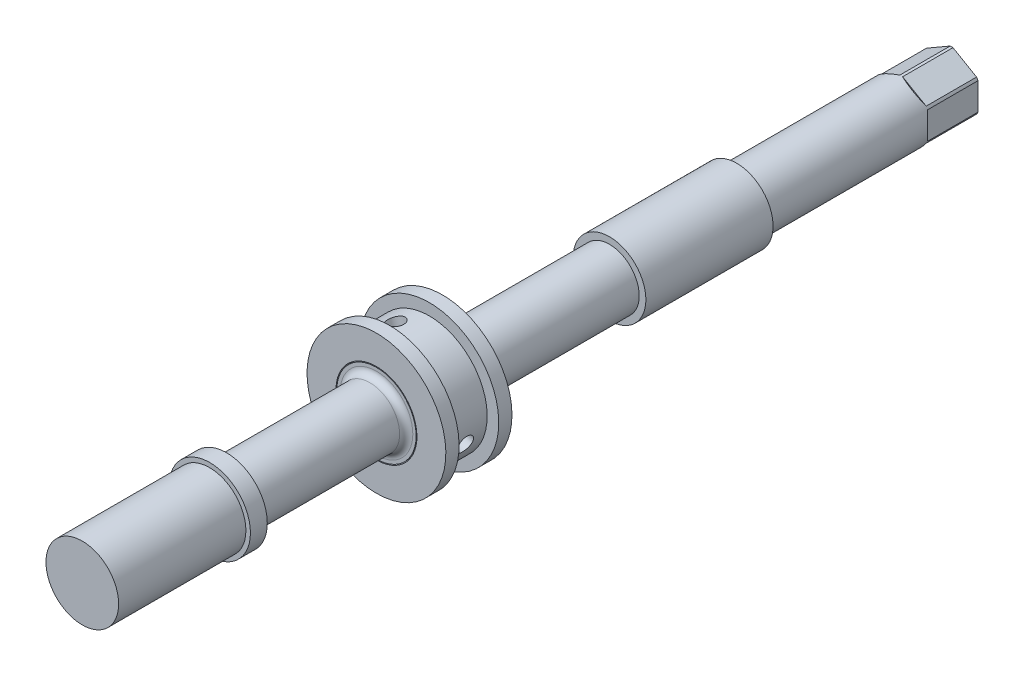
ISO-10303-21;
HEADER;
FILE_DESCRIPTION(('STEP AP214'),'2;1');
FILE_NAME('part.step','',(''),(''),'','','');
FILE_SCHEMA(('AUTOMOTIVE_DESIGN { 1 0 10303 214 1 1 1 1 }'));
ENDSEC;
DATA;
#1=APPLICATION_CONTEXT('core data for automotive mechanical design processes');
#2=APPLICATION_PROTOCOL_DEFINITION('international standard','automotive_design',2000,#1);
#3=PRODUCT_CONTEXT('',#1,'mechanical');
#4=PRODUCT('Part','Part','',(#3));
#5=PRODUCT_RELATED_PRODUCT_CATEGORY('part','',(#4));
#6=PRODUCT_DEFINITION_FORMATION('','',#4);
#7=PRODUCT_DEFINITION_CONTEXT('part definition',#1,'design');
#8=PRODUCT_DEFINITION('design','',#6,#7);
#9=PRODUCT_DEFINITION_SHAPE('','',#8);
#10=(LENGTH_UNIT() NAMED_UNIT(*) SI_UNIT(.MILLI.,.METRE.));
#11=(NAMED_UNIT(*) PLANE_ANGLE_UNIT() SI_UNIT($,.RADIAN.));
#12=(NAMED_UNIT(*) SI_UNIT($,.STERADIAN.) SOLID_ANGLE_UNIT());
#13=UNCERTAINTY_MEASURE_WITH_UNIT(LENGTH_MEASURE(1.E-05),#10,'distance_accuracy_value','');
#14=(GEOMETRIC_REPRESENTATION_CONTEXT(3) GLOBAL_UNCERTAINTY_ASSIGNED_CONTEXT((#13)) GLOBAL_UNIT_ASSIGNED_CONTEXT((#10,
#11,#12)) REPRESENTATION_CONTEXT('',''));
#15=CARTESIAN_POINT('',(0.,0.,0.));
#16=DIRECTION('',(0.,0.,1.));
#17=DIRECTION('',(1.,0.,0.));
#18=AXIS2_PLACEMENT_3D('',#15,#16,#17);
#19=CARTESIAN_POINT('',(0.,0.,10.));
#20=DIRECTION('',(0.,0.,1.));
#21=DIRECTION('',(1.,0.,0.));
#22=AXIS2_PLACEMENT_3D('',#19,#20,#21);
#23=PLANE('',#22);
#24=CARTESIAN_POINT('',(0.,0.,10.));
#25=DIRECTION('',(0.,0.,1.));
#26=DIRECTION('',(-1.,0.,0.));
#27=AXIS2_PLACEMENT_3D('',#24,#25,#26);
#28=CIRCLE('',#27,11.);
#29=CARTESIAN_POINT('',(11.,0.,10.));
#30=VERTEX_POINT('',#29);
#31=CARTESIAN_POINT('',(-11.,0.,10.));
#32=VERTEX_POINT('',#31);
#33=EDGE_CURVE('E263',#30,#32,#28,.F.);
#34=ORIENTED_EDGE('',*,*,#33,.T.);
#35=CARTESIAN_POINT('',(0.,0.,10.));
#36=DIRECTION('',(0.,0.,1.));
#37=DIRECTION('',(1.,0.,0.));
#38=AXIS2_PLACEMENT_3D('',#35,#36,#37);
#39=CIRCLE('',#38,11.);
#40=EDGE_CURVE('E158',#32,#30,#39,.F.);
#41=ORIENTED_EDGE('',*,*,#40,.T.);
#42=EDGE_LOOP('',(#34,#41));
#43=FACE_BOUND('',#42,.T.);
#44=CARTESIAN_POINT('',(0.,0.,10.));
#45=DIRECTION('',(0.,0.,1.));
#46=DIRECTION('',(1.,0.,0.));
#47=AXIS2_PLACEMENT_3D('',#44,#45,#46);
#48=CIRCLE('',#47,12.);
#49=CARTESIAN_POINT('',(12.,0.,10.));
#50=VERTEX_POINT('',#49);
#51=EDGE_CURVE('E25',#50,#50,#48,.T.);
#52=ORIENTED_EDGE('',*,*,#51,.T.);
#53=EDGE_LOOP('',(#52));
#54=FACE_BOUND('',#53,.T.);
#55=ADVANCED_FACE('F17',(#43,#54),#23,.T.);
#56=CARTESIAN_POINT('',(0.,0.,60.5));
#57=DIRECTION('',(0.,0.,-1.));
#58=DIRECTION('',(-1.,0.,0.));
#59=AXIS2_PLACEMENT_3D('',#56,#57,#58);
#60=CYLINDRICAL_SURFACE('',#59,9.);
#61=CARTESIAN_POINT('',(0.,0.,55.3293802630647));
#62=DIRECTION('',(0.,0.,-1.));
#63=DIRECTION('',(-1.,0.,0.));
#64=AXIS2_PLACEMENT_3D('',#61,#62,#63);
#65=CIRCLE('',#64,9.);
#66=CARTESIAN_POINT('',(-8.99999999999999,0.,55.3293802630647));
#67=VERTEX_POINT('',#66);
#68=EDGE_CURVE('E11',#67,#67,#65,.F.);
#69=ORIENTED_EDGE('',*,*,#68,.F.);
#70=EDGE_LOOP('',(#69));
#71=FACE_BOUND('',#70,.T.);
#72=CARTESIAN_POINT('',(0.,0.,12.));
#73=DIRECTION('',(0.,0.,1.));
#74=DIRECTION('',(1.,0.,0.));
#75=AXIS2_PLACEMENT_3D('',#72,#73,#74);
#76=CIRCLE('',#75,9.);
#77=CARTESIAN_POINT('',(9.,0.,12.));
#78=VERTEX_POINT('',#77);
#79=EDGE_CURVE('E162',#78,#78,#76,.T.);
#80=ORIENTED_EDGE('',*,*,#79,.T.);
#81=EDGE_LOOP('',(#80));
#82=FACE_BOUND('',#81,.T.);
#83=ADVANCED_FACE('F214',(#71,#82),#60,.T.);
#84=CARTESIAN_POINT('',(0.,0.,12.));
#85=DIRECTION('',(0.,0.,1.));
#86=DIRECTION('',(1.,0.,0.));
#87=AXIS2_PLACEMENT_3D('',#84,#85,#86);
#88=TOROIDAL_SURFACE('',#87,11.,2.);
#89=ORIENTED_EDGE('',*,*,#79,.F.);
#90=EDGE_LOOP('',(#89));
#91=FACE_BOUND('',#90,.T.);
#92=ORIENTED_EDGE('',*,*,#33,.F.);
#93=ORIENTED_EDGE('',*,*,#40,.F.);
#94=EDGE_LOOP('',(#92,#93));
#95=FACE_BOUND('',#94,.T.);
#96=ADVANCED_FACE('F209',(#91,#95),#88,.F.);
#97=CARTESIAN_POINT('',(0.,0.,5.));
#98=DIRECTION('',(0.,0.,1.));
#99=DIRECTION('',(1.,0.,0.));
#100=AXIS2_PLACEMENT_3D('',#97,#98,#99);
#101=PLANE('',#100);
#102=CARTESIAN_POINT('',(0.,0.,5.));
#103=DIRECTION('',(0.,0.,1.));
#104=DIRECTION('',(1.,0.,0.));
#105=AXIS2_PLACEMENT_3D('',#102,#103,#104);
#106=CIRCLE('',#105,12.);
#107=CARTESIAN_POINT('',(12.,0.,5.));
#108=VERTEX_POINT('',#107);
#109=EDGE_CURVE('E283',#108,#108,#106,.T.);
#110=ORIENTED_EDGE('',*,*,#109,.F.);
#111=EDGE_LOOP('',(#110));
#112=FACE_BOUND('',#111,.T.);
#113=CARTESIAN_POINT('',(0.,0.,5.));
#114=DIRECTION('',(0.,0.,-1.));
#115=DIRECTION('',(-1.,0.,0.));
#116=AXIS2_PLACEMENT_3D('',#113,#114,#115);
#117=CIRCLE('',#116,11.25);
#118=CARTESIAN_POINT('',(-11.25,0.,5.));
#119=VERTEX_POINT('',#118);
#120=EDGE_CURVE('E155',#119,#119,#117,.T.);
#121=ORIENTED_EDGE('',*,*,#120,.F.);
#122=EDGE_LOOP('',(#121));
#123=FACE_BOUND('',#122,.T.);
#124=ADVANCED_FACE('F213',(#112,#123),#101,.F.);
#125=CARTESIAN_POINT('',(0.,0.,5.));
#126=DIRECTION('',(0.,0.,-1.));
#127=DIRECTION('',(-1.,0.,0.));
#128=AXIS2_PLACEMENT_3D('',#125,#126,#127);
#129=CYLINDRICAL_SURFACE('',#128,11.25);
#130=ORIENTED_EDGE('',*,*,#120,.T.);
#131=EDGE_LOOP('',(#130));
#132=FACE_BOUND('',#131,.T.);
#133=CARTESIAN_POINT('',(0.,0.,3.));
#134=DIRECTION('',(0.,0.,-1.));
#135=DIRECTION('',(-1.,0.,0.));
#136=AXIS2_PLACEMENT_3D('',#133,#134,#135);
#137=CIRCLE('',#136,11.25);
#138=CARTESIAN_POINT('',(-11.25,0.,3.));
#139=VERTEX_POINT('',#138);
#140=EDGE_CURVE('E151',#139,#139,#137,.F.);
#141=ORIENTED_EDGE('',*,*,#140,.T.);
#142=EDGE_LOOP('',(#141));
#143=FACE_BOUND('',#142,.T.);
#144=ADVANCED_FACE('F188',(#132,#143),#129,.T.);
#145=CARTESIAN_POINT('',(0.,0.,3.));
#146=DIRECTION('',(0.,0.,-1.));
#147=DIRECTION('',(-1.,0.,0.));
#148=AXIS2_PLACEMENT_3D('',#145,#146,#147);
#149=PLANE('',#148);
#150=CARTESIAN_POINT('',(0.,0.,3.));
#151=DIRECTION('',(0.,0.,-1.));
#152=DIRECTION('',(-1.,0.,0.));
#153=AXIS2_PLACEMENT_3D('',#150,#151,#152);
#154=CIRCLE('',#153,12.25);
#155=CARTESIAN_POINT('',(-12.25,0.,3.));
#156=VERTEX_POINT('',#155);
#157=EDGE_CURVE('E291',#156,#156,#154,.T.);
#158=ORIENTED_EDGE('',*,*,#157,.F.);
#159=EDGE_LOOP('',(#158));
#160=FACE_BOUND('',#159,.T.);
#161=ORIENTED_EDGE('',*,*,#140,.F.);
#162=EDGE_LOOP('',(#161));
#163=FACE_BOUND('',#162,.T.);
#164=ADVANCED_FACE('F330',(#160,#163),#149,.F.);
#165=CARTESIAN_POINT('',(0.,0.,3.));
#166=DIRECTION('',(0.,0.,1.));
#167=DIRECTION('',(1.,0.,0.));
#168=AXIS2_PLACEMENT_3D('',#165,#166,#167);
#169=CYLINDRICAL_SURFACE('',#168,12.);
#170=ORIENTED_EDGE('',*,*,#51,.F.);
#171=EDGE_LOOP('',(#170));
#172=FACE_BOUND('',#171,.T.);
#173=ORIENTED_EDGE('',*,*,#109,.T.);
#174=EDGE_LOOP('',(#173));
#175=FACE_BOUND('',#174,.T.);
#176=ADVANCED_FACE('F277',(#172,#175),#169,.T.);
#177=CARTESIAN_POINT('',(0.,0.,-5.));
#178=DIRECTION('',(0.,0.,1.));
#179=DIRECTION('',(0.240280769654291,-0.970703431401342,0.));
#180=AXIS2_PLACEMENT_3D('',#177,#178,#179);
#181=CYLINDRICAL_SURFACE('',#180,12.25);
#182=CARTESIAN_POINT('',(1.38777878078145E-13,0.,10.));
#183=DIRECTION('',(0.,0.,1.));
#184=DIRECTION('',(0.240280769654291,-0.970703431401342,0.));
#185=AXIS2_PLACEMENT_3D('',#182,#183,#184);
#186=CIRCLE('',#185,12.25);
#187=CARTESIAN_POINT('',(2.9434394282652,-11.8911170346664,10.0000000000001));
#188=VERTEX_POINT('',#187);
#189=EDGE_CURVE('E538',#188,#188,#186,.T.);
#190=ORIENTED_EDGE('',*,*,#189,.T.);
#191=EDGE_LOOP('',(#190));
#192=FACE_BOUND('',#191,.T.);
#193=ORIENTED_EDGE('',*,*,#157,.T.);
#194=EDGE_LOOP('',(#193));
#195=FACE_BOUND('',#194,.T.);
#196=ADVANCED_FACE('F329',(#192,#195),#181,.F.);
#197=CARTESIAN_POINT('',(0.,0.,-6.));
#198=DIRECTION('',(0.,0.,1.));
#199=DIRECTION('',(0.240280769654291,-0.970703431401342,0.));
#200=AXIS2_PLACEMENT_3D('',#197,#198,#199);
#201=PLANE('',#200);
#202=CARTESIAN_POINT('',(0.,0.,-6.));
#203=DIRECTION('',(0.,0.,1.));
#204=DIRECTION('',(0.240280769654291,-0.970703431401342,0.));
#205=AXIS2_PLACEMENT_3D('',#202,#203,#204);
#206=CIRCLE('',#205,17.5);
#207=CARTESIAN_POINT('',(4.20491346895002,-16.9873100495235,-5.99999999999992));
#208=VERTEX_POINT('',#207);
#209=EDGE_CURVE('E478',#208,#208,#206,.F.);
#210=ORIENTED_EDGE('',*,*,#209,.T.);
#211=EDGE_LOOP('',(#210));
#212=FACE_BOUND('',#211,.T.);
#213=CARTESIAN_POINT('',(0.,0.,-6.));
#214=DIRECTION('',(0.,0.,1.));
#215=DIRECTION('',(0.240280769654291,-0.970703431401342,0.));
#216=AXIS2_PLACEMENT_3D('',#213,#214,#215);
#217=CIRCLE('',#216,21.);
#218=CARTESIAN_POINT('',(5.04589616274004,-20.3847720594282,-5.9999999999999));
#219=VERTEX_POINT('',#218);
#220=EDGE_CURVE('E505',#219,#219,#217,.T.);
#221=ORIENTED_EDGE('',*,*,#220,.T.);
#222=EDGE_LOOP('',(#221));
#223=FACE_BOUND('',#222,.T.);
#224=ADVANCED_FACE('F491',(#212,#223),#201,.T.);
#225=CARTESIAN_POINT('',(1.38777878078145E-13,0.,10.));
#226=DIRECTION('',(0.,0.,-1.));
#227=DIRECTION('',(-0.240280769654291,0.970703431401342,0.));
#228=AXIS2_PLACEMENT_3D('',#225,#226,#227);
#229=CYLINDRICAL_SURFACE('',#228,21.);
#230=CARTESIAN_POINT('',(1.38777878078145E-13,0.,10.));
#231=DIRECTION('',(0.,0.,1.));
#232=DIRECTION('',(0.240280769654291,-0.970703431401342,0.));
#233=AXIS2_PLACEMENT_3D('',#230,#231,#232);
#234=CIRCLE('',#233,21.);
#235=CARTESIAN_POINT('',(5.04589616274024,-20.3847720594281,10.0000000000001));
#236=VERTEX_POINT('',#235);
#237=EDGE_CURVE('E542',#236,#236,#234,.F.);
#238=ORIENTED_EDGE('',*,*,#237,.T.);
#239=EDGE_LOOP('',(#238));
#240=FACE_BOUND('',#239,.T.);
#241=CARTESIAN_POINT('',(0.,0.,6.));
#242=DIRECTION('',(0.,0.,1.));
#243=DIRECTION('',(0.240280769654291,-0.970703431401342,0.));
#244=AXIS2_PLACEMENT_3D('',#241,#242,#243);
#245=CIRCLE('',#244,21.);
#246=CARTESIAN_POINT('',(5.04589616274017,-20.3847720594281,6.0000000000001));
#247=VERTEX_POINT('',#246);
#248=EDGE_CURVE('E535',#247,#247,#245,.T.);
#249=ORIENTED_EDGE('',*,*,#248,.T.);
#250=EDGE_LOOP('',(#249));
#251=FACE_BOUND('',#250,.T.);
#252=ADVANCED_FACE('F518',(#240,#251),#229,.T.);
#253=CARTESIAN_POINT('',(1.38777878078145E-13,0.,10.));
#254=DIRECTION('',(0.,0.,1.));
#255=DIRECTION('',(0.240280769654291,-0.970703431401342,0.));
#256=AXIS2_PLACEMENT_3D('',#253,#254,#255);
#257=PLANE('',#256);
#258=ORIENTED_EDGE('',*,*,#189,.F.);
#259=EDGE_LOOP('',(#258));
#260=FACE_BOUND('',#259,.T.);
#261=ORIENTED_EDGE('',*,*,#237,.F.);
#262=EDGE_LOOP('',(#261));
#263=FACE_BOUND('',#262,.T.);
#264=ADVANCED_FACE('F516',(#260,#263),#257,.T.);
#265=CARTESIAN_POINT('',(0.,0.,6.));
#266=DIRECTION('',(0.,0.,1.));
#267=DIRECTION('',(0.240280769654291,-0.970703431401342,0.));
#268=AXIS2_PLACEMENT_3D('',#265,#266,#267);
#269=PLANE('',#268);
#270=ORIENTED_EDGE('',*,*,#248,.F.);
#271=EDGE_LOOP('',(#270));
#272=FACE_BOUND('',#271,.T.);
#273=CARTESIAN_POINT('',(0.,0.,6.));
#274=DIRECTION('',(0.,0.,1.));
#275=DIRECTION('',(0.240280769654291,-0.970703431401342,0.));
#276=AXIS2_PLACEMENT_3D('',#273,#274,#275);
#277=CIRCLE('',#276,17.5);
#278=CARTESIAN_POINT('',(4.20491346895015,-16.9873100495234,6.00000000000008));
#279=VERTEX_POINT('',#278);
#280=EDGE_CURVE('E504',#279,#279,#277,.F.);
#281=ORIENTED_EDGE('',*,*,#280,.F.);
#282=EDGE_LOOP('',(#281));
#283=FACE_BOUND('',#282,.T.);
#284=ADVANCED_FACE('F511',(#272,#283),#269,.F.);
#285=CARTESIAN_POINT('',(16.8138987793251,-4.85209313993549,-1.47267481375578E-13));
#286=DIRECTION('',(0.960794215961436,-0.27726246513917,0.));
#287=DIRECTION('',(0.27726246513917,0.960794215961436,0.));
#288=AXIS2_PLACEMENT_3D('',#285,#286,#287);
#289=CYLINDRICAL_SURFACE('',#288,2.5);
#290=CARTESIAN_POINT('',(11.7697291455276,-3.39646519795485,-2.5000000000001));
#291=CARTESIAN_POINT('',(11.7312199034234,-3.52990154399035,-2.49999496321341));
#292=CARTESIAN_POINT('',(11.6904056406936,-3.66273835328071,-2.48838797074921));
#293=CARTESIAN_POINT('',(11.6055328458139,-3.92338385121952,-2.44230592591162));
#294=CARTESIAN_POINT('',(11.561471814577,-4.05118854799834,-2.40781309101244));
#295=CARTESIAN_POINT('',(11.4719542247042,-4.29813986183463,-2.31707257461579));
#296=CARTESIAN_POINT('',(11.4264990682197,-4.41729479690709,-2.26084613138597));
#297=CARTESIAN_POINT('',(11.3362211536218,-4.64408302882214,-2.12829849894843));
#298=CARTESIAN_POINT('',(11.2913983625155,-4.75171692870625,-2.05197836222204));
#299=CARTESIAN_POINT('',(11.2040396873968,-4.95422296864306,-1.88027156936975));
#300=CARTESIAN_POINT('',(11.1615397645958,-5.04891708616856,-1.78465664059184));
#301=CARTESIAN_POINT('',(11.0817518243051,-5.22171966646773,-1.57756499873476));
#302=CARTESIAN_POINT('',(11.0444642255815,-5.29982679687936,-1.46608701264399));
#303=CARTESIAN_POINT('',(10.9769599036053,-5.4382773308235,-1.22912398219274));
#304=CARTESIAN_POINT('',(10.9468137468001,-5.49844486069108,-1.10351588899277));
#305=CARTESIAN_POINT('',(10.8959866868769,-5.59849477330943,-0.842672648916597));
#306=CARTESIAN_POINT('',(10.8753048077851,-5.63837924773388,-0.707438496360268));
#307=CARTESIAN_POINT('',(10.8450194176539,-5.69641300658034,-0.433132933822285));
#308=CARTESIAN_POINT('',(10.8352687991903,-5.71485103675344,-0.294138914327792));
#309=CARTESIAN_POINT('',(10.8270183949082,-5.73046737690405,-0.0146378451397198));
#310=CARTESIAN_POINT('',(10.8285174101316,-5.72764795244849,0.125869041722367));
#311=CARTESIAN_POINT('',(10.842545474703,-5.70104549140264,0.40207142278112));
#312=CARTESIAN_POINT('',(10.854900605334,-5.67759299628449,0.537807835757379));
#313=CARTESIAN_POINT('',(10.889580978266,-5.61078690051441,0.802957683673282));
#314=CARTESIAN_POINT('',(10.9119067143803,-5.56743231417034,0.932370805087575));
#315=CARTESIAN_POINT('',(10.9653004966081,-5.46152069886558,1.18224924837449));
#316=CARTESIAN_POINT('',(10.9964287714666,-5.3988310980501,1.30264543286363));
#317=CARTESIAN_POINT('',(11.0654885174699,-5.25583011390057,1.53031040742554));
#318=CARTESIAN_POINT('',(11.1034208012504,-5.17551662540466,1.63757762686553));
#319=CARTESIAN_POINT('',(11.184718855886,-4.99742951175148,1.83804954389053));
#320=CARTESIAN_POINT('',(11.2281731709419,-4.8993567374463,1.93095284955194));
#321=CARTESIAN_POINT('',(11.3175823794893,-4.68912107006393,2.09766245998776));
#322=CARTESIAN_POINT('',(11.3635373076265,-4.57695798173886,2.17146850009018));
#323=CARTESIAN_POINT('',(11.4557136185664,-4.34110162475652,2.29794816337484));
#324=CARTESIAN_POINT('',(11.5019353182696,-4.21738940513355,2.35058627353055));
#325=CARTESIAN_POINT('',(11.5924265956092,-3.9618799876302,2.43290882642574));
#326=CARTESIAN_POINT('',(11.6366964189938,-3.83008381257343,2.46259616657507));
#327=CARTESIAN_POINT('',(11.7207543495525,-3.56447496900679,2.4977453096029));
#328=CARTESIAN_POINT('',(11.7606070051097,-3.43073722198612,2.5036194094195));
#329=CARTESIAN_POINT('',(11.8354476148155,-3.16291172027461,2.49208719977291));
#330=CARTESIAN_POINT('',(11.870435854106,-3.02882398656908,2.47468225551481));
#331=CARTESIAN_POINT('',(11.9345207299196,-2.76548730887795,2.41742843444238));
#332=CARTESIAN_POINT('',(11.9636696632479,-2.63620472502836,2.37779210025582));
#333=CARTESIAN_POINT('',(12.0162960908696,-2.38487508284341,2.27743365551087));
#334=CARTESIAN_POINT('',(12.0397731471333,-2.26282858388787,2.21670991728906));
#335=CARTESIAN_POINT('',(12.0815664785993,-2.02797289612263,2.07501540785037));
#336=CARTESIAN_POINT('',(12.0998135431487,-1.915300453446,1.99379767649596));
#337=CARTESIAN_POINT('',(12.1313443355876,-1.70422822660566,1.81375015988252));
#338=CARTESIAN_POINT('',(12.1446275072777,-1.60583004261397,1.71491840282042));
#339=CARTESIAN_POINT('',(12.1672036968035,-1.42482437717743,1.50056807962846));
#340=CARTESIAN_POINT('',(12.1764299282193,-1.34249277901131,1.38480922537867));
#341=CARTESIAN_POINT('',(12.1914678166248,-1.19828653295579,1.14097576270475));
#342=CARTESIAN_POINT('',(12.1972796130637,-1.13641104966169,1.01290165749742));
#343=CARTESIAN_POINT('',(12.2062575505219,-1.0355405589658,0.748729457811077));
#344=CARTESIAN_POINT('',(12.2094377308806,-0.996424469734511,0.612678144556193));
#345=CARTESIAN_POINT('',(12.2137578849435,-0.942006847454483,0.335866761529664));
#346=CARTESIAN_POINT('',(12.2148981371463,-0.92670206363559,0.19510733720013));
#347=CARTESIAN_POINT('',(12.2153635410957,-0.920543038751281,-0.0842749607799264));
#348=CARTESIAN_POINT('',(12.2147226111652,-0.929231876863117,-0.222887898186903));
#349=CARTESIAN_POINT('',(12.2115712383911,-0.969759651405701,-0.496658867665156));
#350=CARTESIAN_POINT('',(12.2090608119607,-1.00159838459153,-0.631816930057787));
#351=CARTESIAN_POINT('',(12.2017373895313,-1.08716471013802,-0.894541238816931));
#352=CARTESIAN_POINT('',(12.1969304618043,-1.14083456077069,-1.02212650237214));
#353=CARTESIAN_POINT('',(12.1843391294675,-1.26825097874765,-1.26668040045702));
#354=CARTESIAN_POINT('',(12.1765544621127,-1.3419993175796,-1.38364809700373));
#355=CARTESIAN_POINT('',(12.1570316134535,-1.50871816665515,-1.60587476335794));
#356=CARTESIAN_POINT('',(12.1452259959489,-1.60200534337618,-1.71089028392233));
#357=CARTESIAN_POINT('',(12.1168480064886,-1.80413104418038,-1.9039891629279));
#358=CARTESIAN_POINT('',(12.100274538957,-1.91297313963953,-1.99206862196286));
#359=CARTESIAN_POINT('',(12.0614548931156,-2.14422197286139,-2.1497111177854));
#360=CARTESIAN_POINT('',(12.0391484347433,-2.26676451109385,-2.21906025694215));
#361=CARTESIAN_POINT('',(11.9885565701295,-2.52065570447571,-2.33583865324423));
#362=CARTESIAN_POINT('',(11.9602765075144,-2.65199641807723,-2.38328738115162));
#363=CARTESIAN_POINT('',(11.9056452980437,-2.8859571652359,-2.44588180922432));
#364=CARTESIAN_POINT('',(11.880581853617,-2.98754122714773,-2.46613942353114));
#365=CARTESIAN_POINT('',(11.8273727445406,-3.1916892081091,-2.49320021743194));
#366=CARTESIAN_POINT('',(11.7992271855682,-3.29425309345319,-2.50000385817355));
#367=CARTESIAN_POINT('',(11.7697291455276,-3.39646519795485,-2.5000000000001));
#368=B_SPLINE_CURVE_WITH_KNOTS('',3,(#290,#291,#292,#293,#294,#295,#296,#297,#298,#299,#300,
#301,#302,#303,#304,#305,#306,#307,#308,#309,#310,#311,#312,#313,#314,#315,#316,#317,#318,#319,
#320,#321,#322,#323,#324,#325,#326,#327,#328,#329,#330,#331,#332,#333,#334,#335,#336,#337,#338,
#339,#340,#341,#342,#343,#344,#345,#346,#347,#348,#349,#350,#351,#352,#353,#354,#355,#356,#357,
#358,#359,#360,#361,#362,#363,#364,#365,#366,#367),.UNSPECIFIED.,.T.,.F.,(4,2,2,2,2,2,2,2,2,2,2,
2,2,2,2,2,2,2,2,2,2,2,2,2,2,2,2,2,2,2,2,2,2,2,2,2,2,2,4),(0.,0.416256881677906,
0.832837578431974,1.24901221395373,1.66516505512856,2.08656509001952,2.50799896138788,
2.93343796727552,3.35883309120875,3.7784320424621,4.19798627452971,4.61093919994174,
5.02391257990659,5.43978297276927,5.85570306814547,6.2794218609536,6.70314652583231,
7.12757912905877,7.55195814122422,7.96895733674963,8.38593207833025,8.79898667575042,
9.21207316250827,9.63039738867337,10.0487684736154,10.4737902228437,10.8987946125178,
11.3215167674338,11.7441812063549,12.1588524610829,12.5735200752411,12.9870979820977,
13.4007123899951,13.821636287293,14.2426569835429,14.6682998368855,15.0935635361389,
15.4124268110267,15.731279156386),.UNSPECIFIED.);
#369=CARTESIAN_POINT('',(11.7697291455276,-3.39646519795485,-2.5000000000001));
#370=VERTEX_POINT('',#369);
#371=EDGE_CURVE('E498',#370,#370,#368,.T.);
#372=ORIENTED_EDGE('',*,*,#371,.T.);
#373=EDGE_LOOP('',(#372));
#374=FACE_BOUND('',#373,.T.);
#375=CARTESIAN_POINT('',(17.334600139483,-2.40034122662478,-1.71269191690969E-13));
#376=CARTESIAN_POINT('',(17.3346006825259,-2.40034744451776,0.139655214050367));
#377=CARTESIAN_POINT('',(17.3329849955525,-2.41209595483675,0.279393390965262));
#378=CARTESIAN_POINT('',(17.3264299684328,-2.45873090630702,0.554968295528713));
#379=CARTESIAN_POINT('',(17.3214873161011,-2.49364040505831,0.690800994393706));
#380=CARTESIAN_POINT('',(17.3080253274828,-2.58541994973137,0.954535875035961));
#381=CARTESIAN_POINT('',(17.299508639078,-2.64227373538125,1.08244384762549));
#382=CARTESIAN_POINT('',(17.2785345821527,-2.7761141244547,1.32686216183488));
#383=CARTESIAN_POINT('',(17.2660777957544,-2.85309775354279,1.4433741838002));
#384=CARTESIAN_POINT('',(17.2367242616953,-3.02539271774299,1.662560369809));
#385=CARTESIAN_POINT('',(17.2197991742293,-3.12081995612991,1.76513964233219));
#386=CARTESIAN_POINT('',(17.1811928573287,-3.32679566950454,1.95272694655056));
#387=CARTESIAN_POINT('',(17.1595113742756,-3.43734495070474,2.03773404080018));
#388=CARTESIAN_POINT('',(17.1110938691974,-3.67079238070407,2.18811137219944));
#389=CARTESIAN_POINT('',(17.0843362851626,-3.7937421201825,2.25339464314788));
#390=CARTESIAN_POINT('',(17.0259007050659,-4.04792431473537,2.36191341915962));
#391=CARTESIAN_POINT('',(16.9942229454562,-4.17915637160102,2.40514998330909));
#392=CARTESIAN_POINT('',(16.9266016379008,-4.44509203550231,2.46806150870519));
#393=CARTESIAN_POINT('',(16.890688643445,-4.57976587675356,2.48789508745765));
#394=CARTESIAN_POINT('',(16.8152302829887,-4.8494986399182,2.5039298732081));
#395=CARTESIAN_POINT('',(16.7756851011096,-4.98455754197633,2.50013227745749));
#396=CARTESIAN_POINT('',(16.6944453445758,-5.25020522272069,2.46913827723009));
#397=CARTESIAN_POINT('',(16.6527685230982,-5.38081939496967,2.44211250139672));
#398=CARTESIAN_POINT('',(16.5684813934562,-5.63501257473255,2.36569680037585));
#399=CARTESIAN_POINT('',(16.5258710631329,-5.75859141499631,2.31630634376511));
#400=CARTESIAN_POINT('',(16.4412810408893,-5.99584955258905,2.1963865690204));
#401=CARTESIAN_POINT('',(16.3993040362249,-6.10949317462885,2.12578481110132));
#402=CARTESIAN_POINT('',(16.3179833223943,-6.32349149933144,1.96549938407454));
#403=CARTESIAN_POINT('',(16.2786397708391,-6.42384540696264,1.87581457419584));
#404=CARTESIAN_POINT('',(16.2041212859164,-6.60958220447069,1.67895674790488));
#405=CARTESIAN_POINT('',(16.1689866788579,-6.69482352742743,1.57163483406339));
#406=CARTESIAN_POINT('',(16.1051054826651,-6.84707350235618,1.34305684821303));
#407=CARTESIAN_POINT('',(16.0763589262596,-6.91408206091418,1.22180070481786));
#408=CARTESIAN_POINT('',(16.0268024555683,-7.02819283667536,0.968649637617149));
#409=CARTESIAN_POINT('',(16.0059977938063,-7.0752818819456,0.836747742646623));
#410=CARTESIAN_POINT('',(15.9735447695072,-7.14824993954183,0.566128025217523));
#411=CARTESIAN_POINT('',(15.9618958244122,-7.17413030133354,0.427410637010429));
#412=CARTESIAN_POINT('',(15.9485011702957,-7.20385855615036,0.148404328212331));
#413=CARTESIAN_POINT('',(15.9466692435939,-7.20789826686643,0.00813996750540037));
#414=CARTESIAN_POINT('',(15.9527843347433,-7.19435369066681,-0.271122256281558));
#415=CARTESIAN_POINT('',(15.9607310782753,-7.17677001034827,-0.410120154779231));
#416=CARTESIAN_POINT('',(15.9858794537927,-7.12057504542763,-0.68226522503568));
#417=CARTESIAN_POINT('',(16.0030392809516,-7.08205873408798,-0.8154359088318));
#418=CARTESIAN_POINT('',(16.0456159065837,-6.98505542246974,-1.07288599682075));
#419=CARTESIAN_POINT('',(16.0710330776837,-6.92656752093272,-1.19716499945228));
#420=CARTESIAN_POINT('',(16.1289456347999,-6.79062500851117,-1.43423984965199));
#421=CARTESIAN_POINT('',(16.1614883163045,-6.71304321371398,-1.54695120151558));
#422=CARTESIAN_POINT('',(16.2318557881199,-6.54106021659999,-1.75682465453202));
#423=CARTESIAN_POINT('',(16.269680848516,-6.44665815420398,-1.85398596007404));
#424=CARTESIAN_POINT('',(16.3490581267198,-6.24262346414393,-2.03074402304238));
#425=CARTESIAN_POINT('',(16.3906362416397,-6.13288160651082,-2.11020315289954));
#426=CARTESIAN_POINT('',(16.4753394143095,-5.9015541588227,-2.24834445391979));
#427=CARTESIAN_POINT('',(16.518464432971,-5.77996886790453,-2.30702714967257));
#428=CARTESIAN_POINT('',(16.604267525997,-5.5286397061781,-2.40172764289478));
#429=CARTESIAN_POINT('',(16.6469466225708,-5.39892504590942,-2.4378219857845));
#430=CARTESIAN_POINT('',(16.730374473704,-5.13456613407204,-2.48656933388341));
#431=CARTESIAN_POINT('',(16.7711233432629,-4.99992217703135,-2.49922373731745));
#432=CARTESIAN_POINT('',(16.8490142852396,-4.73076882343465,-2.50070029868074));
#433=CARTESIAN_POINT('',(16.8861852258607,-4.59626889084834,-2.48973352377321));
#434=CARTESIAN_POINT('',(16.9563951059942,-4.33008291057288,-2.44472981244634));
#435=CARTESIAN_POINT('',(16.989434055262,-4.19839685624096,-2.41069293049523));
#436=CARTESIAN_POINT('',(17.0508108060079,-3.94173396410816,-2.32058752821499));
#437=CARTESIAN_POINT('',(17.0791514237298,-3.81675313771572,-2.26453227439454));
#438=CARTESIAN_POINT('',(17.1309633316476,-3.57703130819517,-2.13200356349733));
#439=CARTESIAN_POINT('',(17.1544344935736,-3.46229057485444,-2.0555295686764));
#440=CARTESIAN_POINT('',(17.1967820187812,-3.24546056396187,-1.88356535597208));
#441=CARTESIAN_POINT('',(17.2156175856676,-3.14348724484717,-1.78791886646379));
#442=CARTESIAN_POINT('',(17.2487361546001,-2.95637515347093,-1.58065304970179));
#443=CARTESIAN_POINT('',(17.26301808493,-2.87124034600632,-1.46902997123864));
#444=CARTESIAN_POINT('',(17.2874849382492,-2.72006908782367,-1.23231820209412));
#445=CARTESIAN_POINT('',(17.2976487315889,-2.6541316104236,-1.10716413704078));
#446=CARTESIAN_POINT('',(17.314173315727,-2.54411564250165,-0.847459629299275));
#447=CARTESIAN_POINT('',(17.3205381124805,-2.50001413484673,-0.71291925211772));
#448=CARTESIAN_POINT('',(17.3283362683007,-2.4452494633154,-0.481454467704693));
#449=CARTESIAN_POINT('',(17.3306902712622,-2.42843663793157,-0.385969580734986));
#450=CARTESIAN_POINT('',(17.3338220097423,-2.40598042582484,-0.193669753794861));
#451=CARTESIAN_POINT('',(17.3345997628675,-2.40033691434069,-0.0968548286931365));
#452=CARTESIAN_POINT('',(17.334600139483,-2.40034122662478,-1.71269191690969E-13));
#453=B_SPLINE_CURVE_WITH_KNOTS('',3,(#375,#376,#377,#378,#379,#380,#381,#382,#383,#384,#385,
#386,#387,#388,#389,#390,#391,#392,#393,#394,#395,#396,#397,#398,#399,#400,#401,#402,#403,#404,
#405,#406,#407,#408,#409,#410,#411,#412,#413,#414,#415,#416,#417,#418,#419,#420,#421,#422,#423,
#424,#425,#426,#427,#428,#429,#430,#431,#432,#433,#434,#435,#436,#437,#438,#439,#440,#441,#442,
#443,#444,#445,#446,#447,#448,#449,#450,#451,#452),.UNSPECIFIED.,.T.,.F.,(4,2,2,2,2,2,2,2,2,2,2,
2,2,2,2,2,2,2,2,2,2,2,2,2,2,2,2,2,2,2,2,2,2,2,2,2,2,2,4),(0.,0.418611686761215,
0.837640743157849,1.25635990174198,1.67501722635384,2.09639644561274,2.5177981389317,
2.94103163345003,3.36424479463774,3.78457277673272,4.20487946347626,4.62212481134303,
5.0393800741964,5.45807684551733,5.87679865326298,6.29925647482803,6.72171646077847,
7.14445536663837,7.56716737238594,7.98616076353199,8.40514240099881,8.82223876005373,
9.23935394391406,9.65932651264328,10.0793205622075,10.5024740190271,10.9256167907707,
11.3473177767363,11.7689936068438,12.1869171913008,12.6048397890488,13.022510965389,
13.4401931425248,13.8614293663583,14.2827646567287,14.7062351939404,15.1292583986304,
15.4195806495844,15.7098996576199),.UNSPECIFIED.);
#454=CARTESIAN_POINT('',(17.334600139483,-2.40034122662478,-1.71269191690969E-13));
#455=VERTEX_POINT('',#454);
#456=EDGE_CURVE('E484',#455,#455,#453,.T.);
#457=ORIENTED_EDGE('',*,*,#456,.T.);
#458=EDGE_LOOP('',(#457));
#459=FACE_BOUND('',#458,.T.);
#460=ADVANCED_FACE('F507',(#374,#459),#289,.F.);
#461=CARTESIAN_POINT('',(-12.6089853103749,-12.1352169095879,2.28293148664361E-13));
#462=DIRECTION('',(-0.72051344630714,-0.693440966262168,0.));
#463=DIRECTION('',(0.693440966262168,-0.72051344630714,0.));
#464=AXIS2_PLACEMENT_3D('',#461,#462,#463);
#465=CYLINDRICAL_SURFACE('',#464,2.5);
#466=CARTESIAN_POINT('',(-8.82628971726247,-8.49465183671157,-2.49999999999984));
#467=CARTESIAN_POINT('',(-8.92259436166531,-8.39458368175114,-2.49999496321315));
#468=CARTESIAN_POINT('',(-9.0172272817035,-8.29281908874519,-2.48838797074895));
#469=CARTESIAN_POINT('',(-9.20051650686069,-8.08899434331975,-2.44230592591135));
#470=CARTESIAN_POINT('',(-9.28916810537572,-7.98693402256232,-2.40781309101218));
#471=CARTESIAN_POINT('',(-9.45827542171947,-7.78593385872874,-2.31707257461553));
#472=CARTESIAN_POINT('',(-9.53873904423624,-7.68699107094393,-2.26084613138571));
#473=CARTESIAN_POINT('',(-9.69000445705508,-7.49541398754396,-2.12829849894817));
#474=CARTESIAN_POINT('',(-9.76080675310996,-7.40277936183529,-2.0519783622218));
#475=CARTESIAN_POINT('',(-9.89250279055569,-7.22587150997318,-1.88027156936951));
#476=CARTESIAN_POINT('',(-9.95326034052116,-7.14171843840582,-1.7846566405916));
#477=CARTESIAN_POINT('',(-10.0630177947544,-6.98621876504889,-1.57756499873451));
#478=CARTESIAN_POINT('',(-10.1120167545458,-6.91487319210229,-1.46608701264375));
#479=CARTESIAN_POINT('',(-10.1981662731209,-6.78718746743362,-1.22912398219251));
#480=CARTESIAN_POINT('',(-10.2351998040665,-6.73099636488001,-1.10351588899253));
#481=CARTESIAN_POINT('',(-10.2964320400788,-6.63695388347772,-0.842672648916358));
#482=CARTESIAN_POINT('',(-10.3206320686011,-6.59910061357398,-0.70743849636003));
#483=CARTESIAN_POINT('',(-10.3557480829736,-6.54385581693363,-0.433132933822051));
#484=CARTESIAN_POINT('',(-10.3668405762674,-6.52619251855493,-0.294138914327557));
#485=CARTESIAN_POINT('',(-10.376239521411,-6.51123928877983,-0.0146378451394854));
#486=CARTESIAN_POINT('',(-10.3745473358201,-6.51394718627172,0.125869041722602));
#487=CARTESIAN_POINT('',(-10.3585229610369,-6.53939707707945,0.402071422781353));
#488=CARTESIAN_POINT('',(-10.344390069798,-6.56182318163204,0.537807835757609));
#489=CARTESIAN_POINT('',(-10.3038744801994,-6.62526031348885,0.802957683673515));
#490=CARTESIAN_POINT('',(-10.277491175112,-6.66627226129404,0.932370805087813));
#491=CARTESIAN_POINT('',(-10.2124659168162,-6.7654684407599,1.18224924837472));
#492=CARTESIAN_POINT('',(-10.1737392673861,-6.823771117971,1.30264543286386));
#493=CARTESIAN_POINT('',(-10.0844266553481,-6.95507910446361,1.53031040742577));
#494=CARTESIAN_POINT('',(-10.0338392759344,-7.02808617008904,1.63757762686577));
#495=CARTESIAN_POINT('',(-9.92026033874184,-7.18753590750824,1.83804954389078));
#496=CARTESIAN_POINT('',(-9.85705398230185,-7.27420483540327,1.93095284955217));
#497=CARTESIAN_POINT('',(-9.71968915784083,-7.45675331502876,2.09766245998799));
#498=CARTESIAN_POINT('',(-9.64553053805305,-7.55263299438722,2.17146850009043));
#499=CARTESIAN_POINT('',(-9.48736109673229,-7.75038819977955,2.29794816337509));
#500=CARTESIAN_POINT('',(-9.40333402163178,-7.85227347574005,2.3505862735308));
#501=CARTESIAN_POINT('',(-9.22730201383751,-8.05839592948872,2.43290882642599));
#502=CARTESIAN_POINT('',(-9.13529808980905,-8.16263280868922,2.46259616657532));
#503=CARTESIAN_POINT('',(-8.94730304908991,-8.36823353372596,2.49774530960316));
#504=CARTESIAN_POINT('',(-8.85140909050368,-8.46961581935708,2.50361940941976));
#505=CARTESIAN_POINT('',(-8.65688570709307,-8.66834243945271,2.49208719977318));
#506=CARTESIAN_POINT('',(-8.55825644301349,-8.76568701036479,2.47468225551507));
#507=CARTESIAN_POINT('',(-8.36224262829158,-8.95285447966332,2.41742843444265));
#508=CARTESIAN_POINT('',(-8.26485509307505,-9.04273948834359,2.3777921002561));
#509=CARTESIAN_POINT('',(-8.07351045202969,-9.2139801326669,2.27743365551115));
#510=CARTESIAN_POINT('',(-7.97955361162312,-9.29533510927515,2.21670991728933));
#511=CARTESIAN_POINT('',(-7.79705928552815,-9.44895703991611,2.07501540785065));
#512=CARTESIAN_POINT('',(-7.70860562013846,-9.52109568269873,1.99379767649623));
#513=CARTESIAN_POINT('',(-7.54157710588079,-9.65393826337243,1.8137501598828));
#514=CARTESIAN_POINT('',(-7.46300336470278,-9.71464091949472,1.7149184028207));
#515=CARTESIAN_POINT('',(-7.31753595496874,-9.824695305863,1.50056807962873));
#516=CARTESIAN_POINT('',(-7.25084781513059,-9.87385125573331,1.38480922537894));
#517=CARTESIAN_POINT('',(-7.13348048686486,-9.95897757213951,1.14097576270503));
#518=CARTESIAN_POINT('',(-7.08280064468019,-9.99494847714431,1.0129016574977));
#519=CARTESIAN_POINT('',(-6.99993320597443,-10.0531588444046,0.748729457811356));
#520=CARTESIAN_POINT('',(-6.9676477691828,-10.0754710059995,0.612678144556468));
#521=CARTESIAN_POINT('',(-6.92268080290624,-10.1064211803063,0.335866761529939));
#522=CARTESIAN_POINT('',(-6.90999659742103,-10.1150610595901,0.195107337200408));
#523=CARTESIAN_POINT('',(-6.90489542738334,-10.1185436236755,-0.0842749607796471));
#524=CARTESIAN_POINT('',(-6.91209971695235,-10.1136441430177,-0.222887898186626));
#525=CARTESIAN_POINT('',(-6.94562211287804,-10.0906510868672,-0.496658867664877));
#526=CARTESIAN_POINT('',(-6.97194005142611,-10.0725576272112,-0.631816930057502));
#527=CARTESIAN_POINT('',(-7.04238095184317,-10.0234321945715,-0.894541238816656));
#528=CARTESIAN_POINT('',(-7.08645694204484,-9.9924343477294,-1.02212650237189));
#529=CARTESIAN_POINT('',(-7.19050713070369,-9.91782172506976,-1.26668040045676));
#530=CARTESIAN_POINT('',(-7.25048273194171,-9.87420583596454,-1.38364809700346));
#531=CARTESIAN_POINT('',(-7.38510406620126,-9.77393912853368,-1.60587476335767));
#532=CARTESIAN_POINT('',(-7.45999032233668,-9.71707157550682,-1.71089028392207));
#533=CARTESIAN_POINT('',(-7.62084731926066,-9.59143266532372,-1.90398916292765));
#534=CARTESIAN_POINT('',(-7.70682060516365,-9.522658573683,-1.99206862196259));
#535=CARTESIAN_POINT('',(-7.88767814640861,-9.37341535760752,-2.14971111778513));
#536=CARTESIAN_POINT('',(-7.98264986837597,-9.29282612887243,-2.21906025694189));
#537=CARTESIAN_POINT('',(-8.1772301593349,-9.12206669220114,-2.33583865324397));
#538=CARTESIAN_POINT('',(-8.27683452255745,-9.0319050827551,-2.38328738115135));
#539=CARTESIAN_POINT('',(-8.45213486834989,-8.86761269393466,-2.44588180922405));
#540=CARTESIAN_POINT('',(-8.52757752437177,-8.79511508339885,-2.46613942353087));
#541=CARTESIAN_POINT('',(-8.67777030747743,-8.64696065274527,-2.49320021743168));
#542=CARTESIAN_POINT('',(-8.75252045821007,-8.57130394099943,-2.50000385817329));
#543=CARTESIAN_POINT('',(-8.82628971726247,-8.49465183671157,-2.49999999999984));
#544=B_SPLINE_CURVE_WITH_KNOTS('',3,(#466,#467,#468,#469,#470,#471,#472,#473,#474,#475,#476,
#477,#478,#479,#480,#481,#482,#483,#484,#485,#486,#487,#488,#489,#490,#491,#492,#493,#494,#495,
#496,#497,#498,#499,#500,#501,#502,#503,#504,#505,#506,#507,#508,#509,#510,#511,#512,#513,#514,
#515,#516,#517,#518,#519,#520,#521,#522,#523,#524,#525,#526,#527,#528,#529,#530,#531,#532,#533,
#534,#535,#536,#537,#538,#539,#540,#541,#542,#543),.UNSPECIFIED.,.T.,.F.,(4,2,2,2,2,2,2,2,2,2,2,
2,2,2,2,2,2,2,2,2,2,2,2,2,2,2,2,2,2,2,2,2,2,2,2,2,2,2,4),(0.,0.416256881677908,
0.832837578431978,1.24901221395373,1.66516505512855,2.08656509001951,2.50799896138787,
2.93343796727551,3.35883309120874,3.77843204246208,4.19798627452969,4.61093919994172,
5.02391257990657,5.43978297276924,5.85570306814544,6.27942186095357,6.70314652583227,
7.12757912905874,7.55195814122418,7.96895733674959,8.38593207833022,8.7989866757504,
9.21207316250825,9.63039738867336,10.0487684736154,10.4737902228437,10.8987946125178,
11.3215167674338,11.7441812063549,12.1588524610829,12.5735200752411,12.9870979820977,
13.4007123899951,13.821636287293,14.2426569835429,14.6682998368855,15.0935635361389,
15.4124268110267,15.731279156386),.UNSPECIFIED.);
#545=CARTESIAN_POINT('',(-8.82628971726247,-8.49465183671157,-2.49999999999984));
#546=VERTEX_POINT('',#545);
#547=EDGE_CURVE('E479',#546,#546,#544,.T.);
#548=ORIENTED_EDGE('',*,*,#547,.T.);
#549=EDGE_LOOP('',(#548));
#550=FACE_BOUND('',#549,.T.);
#551=CARTESIAN_POINT('',(-10.7460565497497,-13.8120334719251,2.20488085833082E-13));
#552=CARTESIAN_POINT('',(-10.7460622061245,-13.8120308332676,0.139655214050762));
#553=CARTESIAN_POINT('',(-10.7554288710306,-13.8047573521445,0.279393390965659));
#554=CARTESIAN_POINT('',(-10.7925384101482,-13.7757630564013,0.554968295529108));
#555=CARTESIAN_POINT('',(-10.8202995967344,-13.7540278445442,0.690800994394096));
#556=CARTESIAN_POINT('',(-10.8930520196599,-13.6964796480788,0.954535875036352));
#557=CARTESIAN_POINT('',(-10.9380304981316,-13.6606770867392,1.08244384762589));
#558=CARTESIAN_POINT('',(-11.0434526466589,-13.5755928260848,1.32686216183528));
#559=CARTESIAN_POINT('',(-11.1038940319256,-13.5263131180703,1.44337418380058));
#560=CARTESIAN_POINT('',(-11.2384290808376,-13.4147447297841,1.66256036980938));
#561=CARTESIAN_POINT('',(-11.3126089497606,-13.3523735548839,1.76513964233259));
#562=CARTESIAN_POINT('',(-11.4716859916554,-13.2159516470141,1.95272694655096));
#563=CARTESIAN_POINT('',(-11.5565837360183,-13.1419002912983,2.03773404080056));
#564=CARTESIAN_POINT('',(-11.7345463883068,-12.983245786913,2.18811137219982));
#565=CARTESIAN_POINT('',(-11.8276451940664,-12.8985981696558,2.25339464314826));
#566=CARTESIAN_POINT('',(-12.0185556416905,-12.7209003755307,2.36191341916));
#567=CARTESIAN_POINT('',(-12.1163670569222,-12.6278506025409,2.40514998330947));
#568=CARTESIAN_POINT('',(-12.3128634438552,-12.4363210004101,2.46806150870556));
#569=CARTESIAN_POINT('',(-12.4115379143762,-12.3378825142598,2.48789508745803));
#570=CARTESIAN_POINT('',(-12.6074041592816,-12.1376672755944,2.50392987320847));
#571=CARTESIAN_POINT('',(-12.7045960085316,-12.0358906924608,2.50013227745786));
#572=CARTESIAN_POINT('',(-12.8940337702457,-11.8327111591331,2.46913827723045));
#573=CARTESIAN_POINT('',(-12.9863105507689,-11.73131088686,2.44211250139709));
#574=CARTESIAN_POINT('',(-13.1643047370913,-11.5312195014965,2.36569680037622));
#575=CARTESIAN_POINT('',(-13.2500219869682,-11.432528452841,2.31630634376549));
#576=CARTESIAN_POINT('',(-13.4131985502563,-11.240642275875,2.19638656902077));
#577=CARTESIAN_POINT('',(-13.4906283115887,-11.1474673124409,2.12578481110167));
#578=CARTESIAN_POINT('',(-13.6352959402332,-10.9700423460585,1.9654993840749));
#579=CARTESIAN_POINT('',(-13.7025331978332,-10.8857928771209,1.87581457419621));
#580=CARTESIAN_POINT('',(-13.8261267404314,-10.7283895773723,1.67895674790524));
#581=CARTESIAN_POINT('',(-13.8823805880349,-10.6553414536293,1.57163483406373));
#582=CARTESIAN_POINT('',(-13.9822923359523,-10.5238937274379,1.34305684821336));
#583=CARTESIAN_POINT('',(-14.0259501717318,-10.4654942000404,1.22180070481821));
#584=CARTESIAN_POINT('',(-14.0999947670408,-10.3655216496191,0.968649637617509));
#585=CARTESIAN_POINT('',(-14.1303727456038,-10.3239597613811,0.836747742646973));
#586=CARTESIAN_POINT('',(-14.1773384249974,-10.2593705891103,0.566128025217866));
#587=CARTESIAN_POINT('',(-14.1939270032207,-10.2363421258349,0.427410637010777));
#588=CARTESIAN_POINT('',(-14.212975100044,-10.2098778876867,0.148404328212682));
#589=CARTESIAN_POINT('',(-14.2155576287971,-10.206271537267,0.00813996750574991));
#590=CARTESIAN_POINT('',(-14.2068852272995,-10.2183396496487,-0.271122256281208));
#591=CARTESIAN_POINT('',(-14.1956306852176,-10.2340135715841,-0.410120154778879));
#592=CARTESIAN_POINT('',(-14.1595386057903,-10.2838901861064,-0.682265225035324));
#593=CARTESIAN_POINT('',(-14.1347624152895,-10.3180091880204,-0.815435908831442));
#594=CARTESIAN_POINT('',(-14.0720433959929,-10.4033832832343,-1.07288599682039));
#595=CARTESIAN_POINT('',(-14.0340999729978,-10.4546391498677,-1.19716499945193));
#596=CARTESIAN_POINT('',(-13.9453265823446,-10.5727641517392,-1.43423984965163));
#597=CARTESIAN_POINT('',(-13.8944101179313,-10.6397378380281,-1.5469512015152));
#598=CARTESIAN_POINT('',(-13.7806522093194,-10.7866693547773,-1.75682465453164));
#599=CARTESIAN_POINT('',(-13.7178101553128,-10.866627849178,-1.85398596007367));
#600=CARTESIAN_POINT('',(-13.5807995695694,-11.0373879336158,-2.03074402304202));
#601=CARTESIAN_POINT('',(-13.5065493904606,-11.1282665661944,-2.11020315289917));
#602=CARTESIAN_POINT('',(-13.3485655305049,-11.3172853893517,-2.24834445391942));
#603=CARTESIAN_POINT('',(-13.264832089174,-11.4154253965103,-2.3070271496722));
#604=CARTESIAN_POINT('',(-13.0900761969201,-11.6153976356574,-2.40172764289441));
#605=CARTESIAN_POINT('',(-12.9990795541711,-11.7172161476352,-2.43782198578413));
#606=CARTESIAN_POINT('',(-12.8118519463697,-11.9216462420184,-2.48656933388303));
#607=CARTESIAN_POINT('',(-12.7156212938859,-12.0242577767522,-2.49922373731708));
#608=CARTESIAN_POINT('',(-12.5214731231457,-12.226289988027,-2.50070029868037));
#609=CARTESIAN_POINT('',(-12.4235782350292,-12.3257309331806,-2.48973352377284));
#610=CARTESIAN_POINT('',(-12.2281593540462,-12.5196274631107,-2.44472981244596));
#611=CARTESIAN_POINT('',(-12.1306353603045,-12.6140830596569,-2.41069293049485));
#612=CARTESIAN_POINT('',(-11.9390471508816,-12.795568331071,-2.32058752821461));
#613=CARTESIAN_POINT('',(-11.8449808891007,-12.8826024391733,-2.26453227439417));
#614=CARTESIAN_POINT('',(-11.6632816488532,-13.047333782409,-2.13200356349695));
#615=CARTESIAN_POINT('',(-11.5756488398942,-13.1250307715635,-2.05552956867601));
#616=CARTESIAN_POINT('',(-11.4090423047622,-13.270119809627,-1.88356535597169));
#617=CARTESIAN_POINT('',(-11.3301486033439,-13.3374185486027,-1.78791886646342));
#618=CARTESIAN_POINT('',(-11.184664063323,-13.4596561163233,-1.58065304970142));
#619=CARTESIAN_POINT('',(-11.1180761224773,-13.5145920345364,-1.46902997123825));
#620=CARTESIAN_POINT('',(-10.9993913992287,-13.6113665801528,-1.23231820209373));
#621=CARTESIAN_POINT('',(-10.9473697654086,-13.6531374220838,-1.1071641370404));
#622=CARTESIAN_POINT('',(-10.8603554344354,-13.7224561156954,-0.847459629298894));
#623=CARTESIAN_POINT('',(-10.8253448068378,-13.7500189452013,-0.71291925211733));
#624=CARTESIAN_POINT('',(-10.7818162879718,-13.7841546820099,-0.481454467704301));
#625=CARTESIAN_POINT('',(-10.7684329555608,-13.7945997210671,-0.385969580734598));
#626=CARTESIAN_POINT('',(-10.7505511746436,-13.8085399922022,-0.193669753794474));
#627=CARTESIAN_POINT('',(-10.7460526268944,-13.8120353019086,-0.0968548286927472));
#628=CARTESIAN_POINT('',(-10.7460565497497,-13.8120334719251,2.20488085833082E-13));
#629=B_SPLINE_CURVE_WITH_KNOTS('',3,(#551,#552,#553,#554,#555,#556,#557,#558,#559,#560,#561,
#562,#563,#564,#565,#566,#567,#568,#569,#570,#571,#572,#573,#574,#575,#576,#577,#578,#579,#580,
#581,#582,#583,#584,#585,#586,#587,#588,#589,#590,#591,#592,#593,#594,#595,#596,#597,#598,#599,
#600,#601,#602,#603,#604,#605,#606,#607,#608,#609,#610,#611,#612,#613,#614,#615,#616,#617,#618,
#619,#620,#621,#622,#623,#624,#625,#626,#627,#628),.UNSPECIFIED.,.T.,.F.,(4,2,2,2,2,2,2,2,2,2,2,
2,2,2,2,2,2,2,2,2,2,2,2,2,2,2,2,2,2,2,2,2,2,2,2,2,2,2,4),(0.,0.418611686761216,
0.837640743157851,1.25635990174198,1.67501722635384,2.09639644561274,2.51779813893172,
2.94103163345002,3.36424479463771,3.7845727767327,4.20487946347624,4.62212481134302,
5.0393800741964,5.45807684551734,5.876798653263,6.29925647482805,6.72171646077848,
7.14445536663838,7.56716737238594,7.986160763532,8.40514240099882,8.82223876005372,
9.23935394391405,9.65932651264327,10.0793205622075,10.5024740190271,10.9256167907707,
11.3473177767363,11.7689936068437,12.1869171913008,12.6048397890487,13.022510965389,
13.4401931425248,13.8614293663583,14.2827646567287,14.7062351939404,15.1292583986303,
15.4195806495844,15.7098996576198),.UNSPECIFIED.);
#630=CARTESIAN_POINT('',(-10.7460565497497,-13.8120334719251,2.20488085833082E-13));
#631=VERTEX_POINT('',#630);
#632=EDGE_CURVE('E163',#631,#631,#629,.T.);
#633=ORIENTED_EDGE('',*,*,#632,.T.);
#634=EDGE_LOOP('',(#633));
#635=FACE_BOUND('',#634,.T.);
#636=ADVANCED_FACE('F457',(#550,#635),#465,.F.);
#637=CARTESIAN_POINT('',(-4.20491346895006,16.9873100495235,0.));
#638=DIRECTION('',(-0.240280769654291,0.970703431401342,0.));
#639=DIRECTION('',(0.,0.,1.));
#640=AXIS2_PLACEMENT_3D('',#637,#638,#639);
#641=CYLINDRICAL_SURFACE('',#640,2.5);
#642=CARTESIAN_POINT('',(-2.94343942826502,11.8911170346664,2.49999999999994));
#643=CARTESIAN_POINT('',(-3.07825208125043,11.8577438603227,2.49999496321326));
#644=CARTESIAN_POINT('',(-3.21255387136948,11.8220444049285,2.48838797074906));
#645=CARTESIAN_POINT('',(-3.47625720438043,11.7472111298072,2.44230592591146));
#646=CARTESIAN_POINT('',(-3.60565485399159,11.708074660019,2.40781309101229));
#647=CARTESIAN_POINT('',(-3.85585183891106,11.6280757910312,2.31707257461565));
#648=CARTESIAN_POINT('',(-3.97665943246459,11.5872151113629,2.26084613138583));
#649=CARTESIAN_POINT('',(-4.20673721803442,11.5056846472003,2.1282984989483));
#650=CARTESIAN_POINT('',(-4.3160080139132,11.4650148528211,2.05197836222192));
#651=CARTESIAN_POINT('',(-4.52170965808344,11.3854719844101,1.88027156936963));
#652=CARTESIAN_POINT('',(-4.61796123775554,11.3466280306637,1.78465664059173));
#653=CARTESIAN_POINT('',(-4.7936913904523,11.2735133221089,1.57756499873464));
#654=CARTESIAN_POINT('',(-4.8731686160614,11.2392429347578,1.46608701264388));
#655=CARTESIAN_POINT('',(-5.0141016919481,11.1770878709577,1.22912398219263));
#656=CARTESIAN_POINT('',(-5.0753790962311,11.1492669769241,1.10351588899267));
#657=CARTESIAN_POINT('',(-5.17730130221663,11.1023070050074,0.842672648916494));
#658=CARTESIAN_POINT('',(-5.21794823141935,11.0831670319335,0.707438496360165));
#659=CARTESIAN_POINT('',(-5.27709875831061,11.0551253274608,0.433132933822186));
#660=CARTESIAN_POINT('',(-5.29589652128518,11.0460876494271,0.294138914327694));
#661=CARTESIAN_POINT('',(-5.31181723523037,11.0384410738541,0.0146378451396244));
#662=CARTESIAN_POINT('',(-5.30894249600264,11.0398310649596,-0.125869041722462));
#663=CARTESIAN_POINT('',(-5.28182254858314,11.0528305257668,-0.402071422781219));
#664=CARTESIAN_POINT('',(-5.25791429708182,11.0642788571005,-0.537807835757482));
#665=CARTESIAN_POINT('',(-5.18982962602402,11.0963765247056,-0.802957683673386));
#666=CARTESIAN_POINT('',(-5.14565220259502,11.117026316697,-0.932370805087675));
#667=CARTESIAN_POINT('',(-5.03777433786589,11.1663267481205,-1.18224924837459));
#668=CARTESIAN_POINT('',(-4.97393911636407,11.1950324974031,-1.30264543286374));
#669=CARTESIAN_POINT('',(-4.82839938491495,11.2585676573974,-1.53031040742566));
#670=CARTESIAN_POINT('',(-4.74669274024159,11.2933977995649,-1.63757762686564));
#671=CARTESIAN_POINT('',(-4.56562412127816,11.3678192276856,-1.83804954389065));
#672=CARTESIAN_POINT('',(-4.46595982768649,11.407487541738,-1.93095284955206));
#673=CARTESIAN_POINT('',(-4.25245572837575,11.4887835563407,-2.09766245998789));
#674=CARTESIAN_POINT('',(-4.13861572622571,11.5304112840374,-2.17146850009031));
#675=CARTESIAN_POINT('',(-3.8994037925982,11.6134916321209,-2.29794816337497));
#676=CARTESIAN_POINT('',(-3.77401291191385,11.654943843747,-2.35058627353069));
#677=CARTESIAN_POINT('',(-3.5152268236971,11.7355880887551,-2.43290882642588));
#678=CARTESIAN_POINT('',(-3.38183262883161,11.774780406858,-2.46259616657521));
#679=CARTESIAN_POINT('',(-3.11320078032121,11.8486094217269,-2.49774530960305));
#680=CARTESIAN_POINT('',(-2.97803552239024,11.8833134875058,-2.50361940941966));
#681=CARTESIAN_POINT('',(-2.70754147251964,11.9478470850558,-2.49208719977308));
#682=CARTESIAN_POINT('',(-2.57221269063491,11.9776769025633,-2.47468225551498));
#683=CARTESIAN_POINT('',(-2.30661589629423,12.0316344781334,-2.41742843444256));
#684=CARTESIAN_POINT('',(-2.17631226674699,12.055813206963,-2.37779210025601));
#685=CARTESIAN_POINT('',(-1.92315232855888,12.098780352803,-2.27743365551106));
#686=CARTESIAN_POINT('',(-1.8002965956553,12.1175683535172,-2.21670991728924));
#687=CARTESIAN_POINT('',(-1.56401322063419,12.1503409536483,-2.07501540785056));
#688=CARTESIAN_POINT('',(-1.45072487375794,12.1642616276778,-1.99379767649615));
#689=CARTESIAN_POINT('',(-1.23860037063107,12.1876896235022,-1.81375015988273));
#690=CARTESIAN_POINT('',(-1.13976583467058,12.1971964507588,-1.71491840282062));
#691=CARTESIAN_POINT('',(-0.958028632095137,12.2128273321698,-1.50056807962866));
#692=CARTESIAN_POINT('',(-0.875404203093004,12.2188952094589,-1.38480922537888));
#693=CARTESIAN_POINT('',(-0.730728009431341,12.2284019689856,-1.14097576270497));
#694=CARTESIAN_POINT('',(-0.668675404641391,12.2318409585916,-1.01290165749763));
#695=CARTESIAN_POINT('',(-0.567535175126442,12.2369510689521,-0.748729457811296));
#696=CARTESIAN_POINT('',(-0.528326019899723,12.2386315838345,-0.612678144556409));
#697=CARTESIAN_POINT('',(-0.473782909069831,12.2408655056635,-0.33586676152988));
#698=CARTESIAN_POINT('',(-0.458445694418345,12.2414190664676,-0.195107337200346));
#699=CARTESIAN_POINT('',(-0.452273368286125,12.241648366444,0.0842749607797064));
#700=CARTESIAN_POINT('',(-0.460980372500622,12.2413405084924,0.222887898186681));
#701=CARTESIAN_POINT('',(-0.501599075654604,12.2397428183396,0.496658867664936));
#702=CARTESIAN_POINT('',(-0.533510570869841,12.2384529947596,0.63181693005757));
#703=CARTESIAN_POINT('',(-0.619294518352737,12.2344103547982,0.894541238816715));
#704=CARTESIAN_POINT('',(-0.67310903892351,12.231661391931,1.02212650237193));
#705=CARTESIAN_POINT('',(-0.800914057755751,12.2239566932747,1.2666804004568));
#706=CARTESIAN_POINT('',(-0.87490633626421,12.2190007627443,1.38364809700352));
#707=CARTESIAN_POINT('',(-1.04225031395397,12.2058740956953,1.60587476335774));
#708=CARTESIAN_POINT('',(-1.1359210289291,12.197648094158,1.71089028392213));
#709=CARTESIAN_POINT('',(-1.33898487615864,12.1770281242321,1.9039891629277));
#710=CARTESIAN_POINT('',(-1.44838161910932,12.1646331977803,1.99206862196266));
#711=CARTESIAN_POINT('',(-1.68094695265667,12.1346940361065,2.14971111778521));
#712=CARTESIAN_POINT('',(-1.80425355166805,12.1170947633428,2.21906025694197));
#713=CARTESIAN_POINT('',(-2.05989528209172,12.0762587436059,2.33583865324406));
#714=CARTESIAN_POINT('',(-2.19222227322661,12.0530270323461,2.38328738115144));
#715=CARTESIAN_POINT('',(-2.4281027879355,12.0073917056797,2.44588180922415));
#716=CARTESIAN_POINT('',(-2.5305718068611,11.9862351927,2.46613942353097));
#717=CARTESIAN_POINT('',(-2.73660696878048,11.9408797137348,2.49320021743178));
#718=CARTESIAN_POINT('',(-2.84017307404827,11.916680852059,2.50000385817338));
#719=CARTESIAN_POINT('',(-2.94343942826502,11.8911170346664,2.49999999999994));
#720=B_SPLINE_CURVE_WITH_KNOTS('',3,(#642,#643,#644,#645,#646,#647,#648,#649,#650,#651,#652,
#653,#654,#655,#656,#657,#658,#659,#660,#661,#662,#663,#664,#665,#666,#667,#668,#669,#670,#671,
#672,#673,#674,#675,#676,#677,#678,#679,#680,#681,#682,#683,#684,#685,#686,#687,#688,#689,#690,
#691,#692,#693,#694,#695,#696,#697,#698,#699,#700,#701,#702,#703,#704,#705,#706,#707,#708,#709,
#710,#711,#712,#713,#714,#715,#716,#717,#718,#719),.UNSPECIFIED.,.T.,.F.,(4,2,2,2,2,2,2,2,2,2,2,
2,2,2,2,2,2,2,2,2,2,2,2,2,2,2,2,2,2,2,2,2,2,2,2,2,2,2,4),(0.,0.416256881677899,0.83283757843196,
1.24901221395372,1.66516505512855,2.08656509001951,2.50799896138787,2.93343796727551,
3.35883309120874,3.77843204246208,4.19798627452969,4.61093919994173,5.02391257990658,
5.43978297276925,5.85570306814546,6.27942186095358,6.70314652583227,7.12757912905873,
7.55195814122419,7.96895733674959,8.38593207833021,8.79898667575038,9.21207316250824,
9.63039738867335,10.0487684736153,10.4737902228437,10.8987946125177,11.3215167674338,
11.7441812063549,12.1588524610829,12.573520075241,12.9870979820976,13.4007123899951,
13.821636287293,14.2426569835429,14.6682998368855,15.0935635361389,15.4124268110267,
15.731279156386),.UNSPECIFIED.);
#721=CARTESIAN_POINT('',(-2.94343942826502,11.8911170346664,2.49999999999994));
#722=VERTEX_POINT('',#721);
#723=EDGE_CURVE('E471',#722,#722,#720,.T.);
#724=ORIENTED_EDGE('',*,*,#723,.T.);
#725=EDGE_LOOP('',(#724));
#726=FACE_BOUND('',#725,.T.);
#727=CARTESIAN_POINT('',(-4.20491346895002,16.9873100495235,2.49999999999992));
#728=CARTESIAN_POINT('',(-4.06934119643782,17.0208663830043,2.49999418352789));
#729=CARTESIAN_POINT('',(-3.93328349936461,17.052806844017,2.48825698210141));
#730=CARTESIAN_POINT('',(-3.66418716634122,17.1126499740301,2.44162715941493));
#731=CARTESIAN_POINT('',(-3.5311516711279,17.1405485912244,2.40671149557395));
#732=CARTESIAN_POINT('',(-3.27214238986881,17.1918732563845,2.31478484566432));
#733=CARTESIAN_POINT('',(-3.14616351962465,17.2153025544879,2.25779000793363));
#734=CARTESIAN_POINT('',(-2.90483730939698,17.2576635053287,2.12336114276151));
#735=CARTESIAN_POINT('',(-2.78948839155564,17.2765958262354,2.04593015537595));
#736=CARTESIAN_POINT('',(-2.57203979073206,17.3103094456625,1.87223957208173));
#737=CARTESIAN_POINT('',(-2.47002901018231,17.3250635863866,1.7758633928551));
#738=CARTESIAN_POINT('',(-2.28314532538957,17.350682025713,1.56726896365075));
#739=CARTESIAN_POINT('',(-2.19827337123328,17.3615461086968,1.45504983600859));
#740=CARTESIAN_POINT('',(-2.04791918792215,17.37992549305,1.21733720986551));
#741=CARTESIAN_POINT('',(-1.98252488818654,17.3874256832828,1.09178688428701));
#742=CARTESIAN_POINT('',(-1.87372235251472,17.39948790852,0.831363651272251));
#743=CARTESIAN_POINT('',(-1.83031303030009,17.4040500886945,0.696491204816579));
#744=CARTESIAN_POINT('',(-1.76712486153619,17.41057960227,0.422224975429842));
#745=CARTESIAN_POINT('',(-1.74718724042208,17.4125643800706,0.28286820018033));
#746=CARTESIAN_POINT('',(-1.73107539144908,17.4141737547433,0.00277773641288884));
#747=CARTESIAN_POINT('',(-1.7348999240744,17.4137984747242,-0.137955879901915));
#748=CARTESIAN_POINT('',(-1.76606212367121,17.4106651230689,-0.415691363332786));
#749=CARTESIAN_POINT('',(-1.79322318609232,17.4079249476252,-0.552713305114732));
#750=CARTESIAN_POINT('',(-1.86993297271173,17.3998512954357,-0.820257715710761));
#751=CARTESIAN_POINT('',(-1.91948227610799,17.3945177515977,-0.950780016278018));
#752=CARTESIAN_POINT('',(-2.03961166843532,17.3808409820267,-1.20215818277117));
#753=CARTESIAN_POINT('',(-2.11026639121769,17.3724870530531,-1.3229777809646));
#754=CARTESIAN_POINT('',(-2.27036813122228,17.3522885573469,-1.55112303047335));
#755=CARTESIAN_POINT('',(-2.35981626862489,17.3404437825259,-1.65844787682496));
#756=CARTESIAN_POINT('',(-2.55572906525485,17.3126572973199,-1.85757600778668));
#757=CARTESIAN_POINT('',(-2.66234054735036,17.2966794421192,-1.94922986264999));
#758=CARTESIAN_POINT('',(-2.88882698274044,17.2602958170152,-2.11324625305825));
#759=CARTESIAN_POINT('',(-3.00870198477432,17.2398900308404,-2.18560871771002));
#760=CARTESIAN_POINT('',(-3.25825393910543,17.1944716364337,-2.30899359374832));
#761=CARTESIAN_POINT('',(-3.38793584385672,17.1694566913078,-2.36000513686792));
#762=CARTESIAN_POINT('',(-3.65321739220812,17.1149736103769,-2.43911367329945));
#763=CARTESIAN_POINT('',(-3.78881667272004,17.0855057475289,-2.46721207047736));
#764=CARTESIAN_POINT('',(-4.06074504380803,17.0229152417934,-2.49949953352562));
#765=CARTESIAN_POINT('',(-4.19705756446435,16.9898265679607,-2.50389415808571));
#766=CARTESIAN_POINT('',(-4.46764589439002,16.9206867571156,-2.48919398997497));
#767=CARTESIAN_POINT('',(-4.6019217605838,16.8846357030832,-2.47009985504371));
#768=CARTESIAN_POINT('',(-4.86408494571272,16.810982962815,-2.40913507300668));
#769=CARTESIAN_POINT('',(-4.99199752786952,16.7733887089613,-2.36736392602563));
#770=CARTESIAN_POINT('',(-5.23861303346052,16.6980111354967,-2.2623353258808));
#771=CARTESIAN_POINT('',(-5.35731555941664,16.6602278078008,-2.19907694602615));
#772=CARTESIAN_POINT('',(-5.58316801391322,16.5859121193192,-2.05238272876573));
#773=CARTESIAN_POINT('',(-5.69023600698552,16.5493897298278,-1.96881571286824));
#774=CARTESIAN_POINT('',(-5.88916922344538,16.4796486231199,-1.78405990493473));
#775=CARTESIAN_POINT('',(-5.98103364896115,16.4464300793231,-1.68287018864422));
#776=CARTESIAN_POINT('',(-6.14785679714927,16.3848053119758,-1.46482912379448));
#777=CARTESIAN_POINT('',(-6.22268343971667,16.3564370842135,-1.3478659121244));
#778=CARTESIAN_POINT('',(-6.35259829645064,16.3064208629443,-1.10213351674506));
#779=CARTESIAN_POINT('',(-6.40768700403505,16.2847727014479,-0.973364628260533));
#780=CARTESIAN_POINT('',(-6.49652012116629,16.2495390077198,-0.708095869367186));
#781=CARTESIAN_POINT('',(-6.53033409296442,16.2359272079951,-0.571622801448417));
#782=CARTESIAN_POINT('',(-6.57598486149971,16.2174917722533,-0.294474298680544));
#783=CARTESIAN_POINT('',(-6.58782302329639,16.2126675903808,-0.153799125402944));
#784=CARTESIAN_POINT('',(-6.58919399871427,16.2121103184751,0.126392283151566));
#785=CARTESIAN_POINT('',(-6.57892882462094,16.2162948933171,0.265907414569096));
#786=CARTESIAN_POINT('',(-6.53678332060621,16.2333290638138,0.541087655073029));
#787=CARTESIAN_POINT('',(-6.50490301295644,16.2461786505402,0.676752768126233));
#788=CARTESIAN_POINT('',(-6.42040374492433,16.2797563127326,0.940331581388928));
#789=CARTESIAN_POINT('',(-6.36779766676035,16.3004794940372,1.06825003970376));
#790=CARTESIAN_POINT('',(-6.24320997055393,16.3486014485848,1.31290305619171));
#791=CARTESIAN_POINT('',(-6.17122782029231,16.376000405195,1.42963730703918));
#792=CARTESIAN_POINT('',(-6.00900085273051,16.4362233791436,1.64970727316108));
#793=CARTESIAN_POINT('',(-5.9186021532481,16.4690926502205,1.75291718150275));
#794=CARTESIAN_POINT('',(-5.72221595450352,16.5383512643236,1.94189963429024));
#795=CARTESIAN_POINT('',(-5.61622482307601,16.5747414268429,2.02766810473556));
#796=CARTESIAN_POINT('',(-5.39084616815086,16.6494122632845,2.17970946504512));
#797=CARTESIAN_POINT('',(-5.27139466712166,16.6877014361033,2.2458833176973));
#798=CARTESIAN_POINT('',(-5.02279209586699,16.7642001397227,2.35617468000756));
#799=CARTESIAN_POINT('',(-4.89365138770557,16.8024097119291,2.4003153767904));
#800=CARTESIAN_POINT('',(-4.67079026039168,16.8654276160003,2.4551044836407));
#801=CARTESIAN_POINT('',(-4.57866226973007,16.8906808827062,2.47191504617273));
#802=CARTESIAN_POINT('',(-4.39273850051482,16.9399852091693,2.49436476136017));
#803=CARTESIAN_POINT('',(-4.2989427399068,16.9640362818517,2.50000403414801));
#804=CARTESIAN_POINT('',(-4.20491346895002,16.9873100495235,2.49999999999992));
#805=B_SPLINE_CURVE_WITH_KNOTS('',3,(#727,#728,#729,#730,#731,#732,#733,#734,#735,#736,#737,
#738,#739,#740,#741,#742,#743,#744,#745,#746,#747,#748,#749,#750,#751,#752,#753,#754,#755,#756,
#757,#758,#759,#760,#761,#762,#763,#764,#765,#766,#767,#768,#769,#770,#771,#772,#773,#774,#775,
#776,#777,#778,#779,#780,#781,#782,#783,#784,#785,#786,#787,#788,#789,#790,#791,#792,#793,#794,
#795,#796,#797,#798,#799,#800,#801,#802,#803,#804),.UNSPECIFIED.,.T.,.F.,(4,2,2,2,2,2,2,2,2,2,2,
2,2,2,2,2,2,2,2,2,2,2,2,2,2,2,2,2,2,2,2,2,2,2,2,2,2,2,4),(0.,0.418636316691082,
0.837689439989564,1.25643665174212,1.67512160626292,2.09646858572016,2.51783891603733,
2.94108360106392,3.36430737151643,3.78465148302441,4.20497366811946,4.62214270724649,
5.03932253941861,5.45799544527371,5.87669331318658,6.29918445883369,6.72167715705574,
7.14438465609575,7.56706625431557,7.98607640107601,8.40507481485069,8.82224947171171,
9.23944212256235,9.65940469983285,10.0793893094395,10.5025265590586,10.9256532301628,
11.3473891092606,11.7690987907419,12.186970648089,12.6048420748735,13.0224541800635,
13.4400777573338,13.8613455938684,14.2827117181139,14.7061725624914,15.1291868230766,
15.419544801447,15.7098996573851),.UNSPECIFIED.);
#806=CARTESIAN_POINT('',(-4.20491346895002,16.9873100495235,2.49999999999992));
#807=VERTEX_POINT('',#806);
#808=EDGE_CURVE('E463',#807,#807,#805,.T.);
#809=ORIENTED_EDGE('',*,*,#808,.T.);
#810=EDGE_LOOP('',(#809));
#811=FACE_BOUND('',#810,.T.);
#812=ADVANCED_FACE('F452',(#726,#811),#641,.F.);
#813=CARTESIAN_POINT('',(0.,0.,-6.));
#814=DIRECTION('',(0.,0.,1.));
#815=DIRECTION('',(0.240280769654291,-0.970703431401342,0.));
#816=AXIS2_PLACEMENT_3D('',#813,#814,#815);
#817=CYLINDRICAL_SURFACE('',#816,17.5);
#818=ORIENTED_EDGE('',*,*,#632,.F.);
#819=EDGE_LOOP('',(#818));
#820=FACE_BOUND('',#819,.T.);
#821=ORIENTED_EDGE('',*,*,#808,.F.);
#822=EDGE_LOOP('',(#821));
#823=FACE_BOUND('',#822,.T.);
#824=ORIENTED_EDGE('',*,*,#456,.F.);
#825=EDGE_LOOP('',(#824));
#826=FACE_BOUND('',#825,.T.);
#827=ORIENTED_EDGE('',*,*,#209,.F.);
#828=EDGE_LOOP('',(#827));
#829=FACE_BOUND('',#828,.T.);
#830=ORIENTED_EDGE('',*,*,#280,.T.);
#831=EDGE_LOOP('',(#830));
#832=FACE_BOUND('',#831,.T.);
#833=ADVANCED_FACE('F456',(#820,#823,#826,#829,#832),#817,.T.);
#834=CARTESIAN_POINT('',(1.38777878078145E-13,0.,10.));
#835=DIRECTION('',(0.,0.,-1.));
#836=DIRECTION('',(-0.240280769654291,0.970703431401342,0.));
#837=AXIS2_PLACEMENT_3D('',#834,#835,#836);
#838=CYLINDRICAL_SURFACE('',#837,21.);
#839=ORIENTED_EDGE('',*,*,#220,.F.);
#840=EDGE_LOOP('',(#839));
#841=FACE_BOUND('',#840,.T.);
#842=CARTESIAN_POINT('',(-1.04083408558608E-13,0.,-10.));
#843=DIRECTION('',(0.,0.,1.));
#844=DIRECTION('',(0.240280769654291,-0.970703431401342,0.));
#845=AXIS2_PLACEMENT_3D('',#842,#843,#844);
#846=CIRCLE('',#845,21.);
#847=CARTESIAN_POINT('',(5.04589616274,-20.3847720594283,-9.9999999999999));
#848=VERTEX_POINT('',#847);
#849=EDGE_CURVE('E547',#848,#848,#846,.T.);
#850=ORIENTED_EDGE('',*,*,#849,.T.);
#851=EDGE_LOOP('',(#850));
#852=FACE_BOUND('',#851,.T.);
#853=ADVANCED_FACE('F441',(#841,#852),#838,.T.);
#854=CARTESIAN_POINT('',(-8.,4.61880215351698,-148.75));
#855=DIRECTION('',(-0.353553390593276,0.612372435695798,-0.707106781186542));
#856=DIRECTION('',(0.,0.75592894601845,0.654653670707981));
#857=AXIS2_PLACEMENT_3D('',#854,#855,#856);
#858=PLANE('',#857);
#859=DIRECTION('',(-0.866025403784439,-0.5,0.));
#860=VECTOR('',#859,1.);
#861=CARTESIAN_POINT('',(-8.,4.61880215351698,-148.75));
#862=LINE('',#861,#860);
#863=CARTESIAN_POINT('',(-7.57071421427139,4.86665041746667,-148.75));
#864=VERTEX_POINT('',#863);
#865=CARTESIAN_POINT('',(-0.429285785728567,8.98975604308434,-148.75));
#866=VERTEX_POINT('',#865);
#867=EDGE_CURVE('E122',#864,#866,#862,.F.);
#868=ORIENTED_EDGE('',*,*,#867,.F.);
#869=CARTESIAN_POINT('',(0.,0.,-156.75));
#870=DIRECTION('',(-0.353553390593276,0.612372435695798,-0.707106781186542));
#871=DIRECTION('',(0.353553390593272,-0.612372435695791,-0.707106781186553));
#872=AXIS2_PLACEMENT_3D('',#869,#870,#871);
#873=ELLIPSE('',#872,12.7279220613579,9.);
#874=EDGE_CURVE('E125',#866,#864,#873,.F.);
#875=ORIENTED_EDGE('',*,*,#874,.F.);
#876=EDGE_LOOP('',(#868,#875));
#877=FACE_BOUND('',#876,.T.);
#878=ADVANCED_FACE('F123',(#877),#858,.T.);
#879=CARTESIAN_POINT('',(-8.,4.61880215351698,-147.25));
#880=DIRECTION('',(-0.5,0.866025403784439,0.));
#881=DIRECTION('',(-0.866025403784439,-0.5,0.));
#882=AXIS2_PLACEMENT_3D('',#879,#880,#881);
#883=PLANE('',#882);
#884=DIRECTION('',(0.866025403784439,0.5,0.));
#885=VECTOR('',#884,1.);
#886=CARTESIAN_POINT('',(-4.,6.9282032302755,-164.));
#887=LINE('',#886,#885);
#888=CARTESIAN_POINT('',(-7.57071421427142,4.86665041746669,-164.));
#889=VERTEX_POINT('',#888);
#890=CARTESIAN_POINT('',(-0.429285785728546,8.98975604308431,-164.));
#891=VERTEX_POINT('',#890);
#892=EDGE_CURVE('E32',#889,#891,#887,.T.);
#893=ORIENTED_EDGE('',*,*,#892,.F.);
#894=DIRECTION('',(0.,0.,-1.));
#895=VECTOR('',#894,1.);
#896=CARTESIAN_POINT('',(-7.57071421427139,4.86665041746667,-99.));
#897=LINE('',#896,#895);
#898=EDGE_CURVE('E130',#864,#889,#897,.T.);
#899=ORIENTED_EDGE('',*,*,#898,.F.);
#900=ORIENTED_EDGE('',*,*,#867,.T.);
#901=DIRECTION('',(0.,0.,-1.));
#902=VECTOR('',#901,1.);
#903=CARTESIAN_POINT('',(-0.429285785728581,8.98975604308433,-99.));
#904=LINE('',#903,#902);
#905=EDGE_CURVE('E136',#891,#866,#904,.F.);
#906=ORIENTED_EDGE('',*,*,#905,.F.);
#907=EDGE_LOOP('',(#893,#899,#900,#906));
#908=FACE_BOUND('',#907,.T.);
#909=ADVANCED_FACE('F131',(#908),#883,.T.);
#910=CARTESIAN_POINT('',(0.,9.23760430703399,-148.75));
#911=DIRECTION('',(0.353553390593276,0.612372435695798,-0.707106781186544));
#912=DIRECTION('',(0.,0.75592894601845,0.65465367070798));
#913=AXIS2_PLACEMENT_3D('',#910,#911,#912);
#914=PLANE('',#913);
#915=DIRECTION('',(-0.866025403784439,0.5,0.));
#916=VECTOR('',#915,1.);
#917=CARTESIAN_POINT('',(0.,9.23760430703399,-148.75));
#918=LINE('',#917,#916);
#919=CARTESIAN_POINT('',(0.429285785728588,8.98975604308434,-148.75));
#920=VERTEX_POINT('',#919);
#921=CARTESIAN_POINT('',(7.57071421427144,4.86665041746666,-148.75));
#922=VERTEX_POINT('',#921);
#923=EDGE_CURVE('E127',#920,#922,#918,.F.);
#924=ORIENTED_EDGE('',*,*,#923,.F.);
#925=CARTESIAN_POINT('',(0.,0.,-156.75));
#926=DIRECTION('',(0.353553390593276,0.612372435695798,-0.707106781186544));
#927=DIRECTION('',(-0.353553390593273,-0.612372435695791,-0.707106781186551));
#928=AXIS2_PLACEMENT_3D('',#925,#926,#927);
#929=ELLIPSE('',#928,12.7279220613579,9.);
#930=EDGE_CURVE('E144',#922,#920,#929,.F.);
#931=ORIENTED_EDGE('',*,*,#930,.F.);
#932=EDGE_LOOP('',(#924,#931));
#933=FACE_BOUND('',#932,.T.);
#934=ADVANCED_FACE('F369',(#933),#914,.T.);
#935=CARTESIAN_POINT('',(0.,9.237604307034,-147.25));
#936=DIRECTION('',(0.5,0.866025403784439,0.));
#937=DIRECTION('',(-0.866025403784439,0.5,0.));
#938=AXIS2_PLACEMENT_3D('',#935,#936,#937);
#939=PLANE('',#938);
#940=DIRECTION('',(0.866025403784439,-0.5,0.));
#941=VECTOR('',#940,1.);
#942=CARTESIAN_POINT('',(4.,6.9282032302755,-164.));
#943=LINE('',#942,#941);
#944=CARTESIAN_POINT('',(0.429285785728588,8.98975604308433,-164.));
#945=VERTEX_POINT('',#944);
#946=CARTESIAN_POINT('',(7.57071421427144,4.86665041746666,-164.));
#947=VERTEX_POINT('',#946);
#948=EDGE_CURVE('E40',#945,#947,#943,.T.);
#949=ORIENTED_EDGE('',*,*,#948,.F.);
#950=DIRECTION('',(0.,0.,-1.));
#951=VECTOR('',#950,1.);
#952=CARTESIAN_POINT('',(0.429285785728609,8.98975604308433,-99.));
#953=LINE('',#952,#951);
#954=EDGE_CURVE('E138',#920,#945,#953,.T.);
#955=ORIENTED_EDGE('',*,*,#954,.F.);
#956=ORIENTED_EDGE('',*,*,#923,.T.);
#957=DIRECTION('',(0.,0.,-1.));
#958=VECTOR('',#957,1.);
#959=CARTESIAN_POINT('',(7.57071421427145,4.86665041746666,-99.));
#960=LINE('',#959,#958);
#961=EDGE_CURVE('E126',#947,#922,#960,.F.);
#962=ORIENTED_EDGE('',*,*,#961,.F.);
#963=EDGE_LOOP('',(#949,#955,#956,#962));
#964=FACE_BOUND('',#963,.T.);
#965=ADVANCED_FACE('F370',(#964),#939,.T.);
#966=CARTESIAN_POINT('',(8.,4.61880215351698,-148.75));
#967=DIRECTION('',(0.707106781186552,0.,-0.707106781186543));
#968=DIRECTION('',(-0.707106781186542,0.,-0.707106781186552));
#969=AXIS2_PLACEMENT_3D('',#966,#967,#968);
#970=PLANE('',#969);
#971=DIRECTION('',(0.,1.,0.));
#972=VECTOR('',#971,1.);
#973=CARTESIAN_POINT('',(8.,4.61880215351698,-148.75));
#974=LINE('',#973,#972);
#975=CARTESIAN_POINT('',(8.,-4.12310562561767,-148.75));
#976=VERTEX_POINT('',#975);
#977=CARTESIAN_POINT('',(8.,4.12310562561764,-148.75));
#978=VERTEX_POINT('',#977);
#979=EDGE_CURVE('E414',#976,#978,#974,.T.);
#980=ORIENTED_EDGE('',*,*,#979,.T.);
#981=CARTESIAN_POINT('',(0.,0.,-156.75));
#982=DIRECTION('',(0.707106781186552,0.,-0.707106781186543));
#983=DIRECTION('',(-0.707106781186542,0.,-0.707106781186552));
#984=AXIS2_PLACEMENT_3D('',#981,#982,#983);
#985=ELLIPSE('',#984,12.7279220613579,9.);
#986=EDGE_CURVE('E292',#976,#978,#985,.F.);
#987=ORIENTED_EDGE('',*,*,#986,.F.);
#988=EDGE_LOOP('',(#980,#987));
#989=FACE_BOUND('',#988,.T.);
#990=ADVANCED_FACE('F373',(#989),#970,.T.);
#991=CARTESIAN_POINT('',(8.,4.61880215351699,-147.25));
#992=DIRECTION('',(1.,0.,0.));
#993=DIRECTION('',(0.,1.,0.));
#994=AXIS2_PLACEMENT_3D('',#991,#992,#993);
#995=PLANE('',#994);
#996=DIRECTION('',(0.,-1.,0.));
#997=VECTOR('',#996,1.);
#998=CARTESIAN_POINT('',(8.,0.,-164.));
#999=LINE('',#998,#997);
#1000=CARTESIAN_POINT('',(8.,4.12310562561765,-164.));
#1001=VERTEX_POINT('',#1000);
#1002=CARTESIAN_POINT('',(8.,-4.12310562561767,-164.));
#1003=VERTEX_POINT('',#1002);
#1004=EDGE_CURVE('E307',#1001,#1003,#999,.T.);
#1005=ORIENTED_EDGE('',*,*,#1004,.F.);
#1006=DIRECTION('',(0.,0.,1.));
#1007=VECTOR('',#1006,1.);
#1008=CARTESIAN_POINT('',(8.,4.12310562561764,-147.25));
#1009=LINE('',#1008,#1007);
#1010=EDGE_CURVE('E417',#1001,#978,#1009,.T.);
#1011=ORIENTED_EDGE('',*,*,#1010,.T.);
#1012=ORIENTED_EDGE('',*,*,#979,.F.);
#1013=DIRECTION('',(0.,0.,-1.));
#1014=VECTOR('',#1013,1.);
#1015=CARTESIAN_POINT('',(8.,-4.12310562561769,-99.));
#1016=LINE('',#1015,#1014);
#1017=EDGE_CURVE('E589',#1003,#976,#1016,.F.);
#1018=ORIENTED_EDGE('',*,*,#1017,.F.);
#1019=EDGE_LOOP('',(#1005,#1011,#1012,#1018));
#1020=FACE_BOUND('',#1019,.T.);
#1021=ADVANCED_FACE('F374',(#1020),#995,.T.);
#1022=CARTESIAN_POINT('',(8.,-4.61880215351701,-148.75));
#1023=DIRECTION('',(0.353553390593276,-0.612372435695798,-0.707106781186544));
#1024=DIRECTION('',(0.,0.755928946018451,-0.654653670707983));
#1025=AXIS2_PLACEMENT_3D('',#1022,#1023,#1024);
#1026=PLANE('',#1025);
#1027=DIRECTION('',(0.866025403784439,0.5,0.));
#1028=VECTOR('',#1027,1.);
#1029=CARTESIAN_POINT('',(8.,-4.61880215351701,-148.75));
#1030=LINE('',#1029,#1028);
#1031=CARTESIAN_POINT('',(7.57071421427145,-4.8666504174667,-148.75));
#1032=VERTEX_POINT('',#1031);
#1033=CARTESIAN_POINT('',(0.429285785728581,-8.98975604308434,-148.75));
#1034=VERTEX_POINT('',#1033);
#1035=EDGE_CURVE('E419',#1032,#1034,#1030,.F.);
#1036=ORIENTED_EDGE('',*,*,#1035,.F.);
#1037=CARTESIAN_POINT('',(0.,0.,-156.75));
#1038=DIRECTION('',(0.353553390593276,-0.612372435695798,-0.707106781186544));
#1039=DIRECTION('',(-0.353553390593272,0.612372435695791,-0.707106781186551));
#1040=AXIS2_PLACEMENT_3D('',#1037,#1038,#1039);
#1041=ELLIPSE('',#1040,12.7279220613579,9.);
#1042=EDGE_CURVE('E590',#1034,#1032,#1041,.F.);
#1043=ORIENTED_EDGE('',*,*,#1042,.F.);
#1044=EDGE_LOOP('',(#1036,#1043));
#1045=FACE_BOUND('',#1044,.T.);
#1046=ADVANCED_FACE('F377',(#1045),#1026,.T.);
#1047=CARTESIAN_POINT('',(8.,-4.61880215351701,-147.25));
#1048=DIRECTION('',(0.5,-0.866025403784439,0.));
#1049=DIRECTION('',(0.866025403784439,0.5,0.));
#1050=AXIS2_PLACEMENT_3D('',#1047,#1048,#1049);
#1051=PLANE('',#1050);
#1052=DIRECTION('',(-0.866025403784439,-0.5,0.));
#1053=VECTOR('',#1052,1.);
#1054=CARTESIAN_POINT('',(4.,-6.92820323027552,-164.));
#1055=LINE('',#1054,#1053);
#1056=CARTESIAN_POINT('',(7.57071421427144,-4.86665041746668,-164.));
#1057=VERTEX_POINT('',#1056);
#1058=CARTESIAN_POINT('',(0.429285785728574,-8.98975604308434,-164.));
#1059=VERTEX_POINT('',#1058);
#1060=EDGE_CURVE('E310',#1057,#1059,#1055,.T.);
#1061=ORIENTED_EDGE('',*,*,#1060,.F.);
#1062=DIRECTION('',(0.,0.,-1.));
#1063=VECTOR('',#1062,1.);
#1064=CARTESIAN_POINT('',(7.57071421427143,-4.86665041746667,-99.));
#1065=LINE('',#1064,#1063);
#1066=EDGE_CURVE('E593',#1032,#1057,#1065,.T.);
#1067=ORIENTED_EDGE('',*,*,#1066,.F.);
#1068=ORIENTED_EDGE('',*,*,#1035,.T.);
#1069=DIRECTION('',(0.,0.,-1.));
#1070=VECTOR('',#1069,1.);
#1071=CARTESIAN_POINT('',(0.429285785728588,-8.98975604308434,-99.));
#1072=LINE('',#1071,#1070);
#1073=EDGE_CURVE('E594',#1059,#1034,#1072,.F.);
#1074=ORIENTED_EDGE('',*,*,#1073,.F.);
#1075=EDGE_LOOP('',(#1061,#1067,#1068,#1074));
#1076=FACE_BOUND('',#1075,.T.);
#1077=ADVANCED_FACE('F379',(#1076),#1051,.T.);
#1078=CARTESIAN_POINT('',(0.,-9.23760430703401,-148.75));
#1079=DIRECTION('',(-0.353553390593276,-0.612372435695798,-0.707106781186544));
#1080=DIRECTION('',(0.,0.755928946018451,-0.654653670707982));
#1081=AXIS2_PLACEMENT_3D('',#1078,#1079,#1080);
#1082=PLANE('',#1081);
#1083=DIRECTION('',(0.866025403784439,-0.5,0.));
#1084=VECTOR('',#1083,1.);
#1085=CARTESIAN_POINT('',(0.,-9.23760430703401,-148.75));
#1086=LINE('',#1085,#1084);
#1087=CARTESIAN_POINT('',(-0.429285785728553,-8.98975604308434,-148.75));
#1088=VERTEX_POINT('',#1087);
#1089=CARTESIAN_POINT('',(-7.57071421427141,-4.86665041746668,-148.75));
#1090=VERTEX_POINT('',#1089);
#1091=EDGE_CURVE('E422',#1088,#1090,#1086,.F.);
#1092=ORIENTED_EDGE('',*,*,#1091,.F.);
#1093=CARTESIAN_POINT('',(0.,0.,-156.75));
#1094=DIRECTION('',(-0.353553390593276,-0.612372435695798,-0.707106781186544));
#1095=DIRECTION('',(0.353553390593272,0.612372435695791,-0.707106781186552));
#1096=AXIS2_PLACEMENT_3D('',#1093,#1094,#1095);
#1097=ELLIPSE('',#1096,12.7279220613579,9.);
#1098=EDGE_CURVE('E410',#1090,#1088,#1097,.F.);
#1099=ORIENTED_EDGE('',*,*,#1098,.F.);
#1100=EDGE_LOOP('',(#1092,#1099));
#1101=FACE_BOUND('',#1100,.T.);
#1102=ADVANCED_FACE('F382',(#1101),#1082,.T.);
#1103=CARTESIAN_POINT('',(0.,-9.23760430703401,-147.25));
#1104=DIRECTION('',(-0.5,-0.866025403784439,0.));
#1105=DIRECTION('',(0.866025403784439,-0.5,0.));
#1106=AXIS2_PLACEMENT_3D('',#1103,#1104,#1105);
#1107=PLANE('',#1106);
#1108=DIRECTION('',(-0.866025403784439,0.5,0.));
#1109=VECTOR('',#1108,1.);
#1110=CARTESIAN_POINT('',(-4.,-6.92820323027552,-164.));
#1111=LINE('',#1110,#1109);
#1112=CARTESIAN_POINT('',(-0.429285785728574,-8.98975604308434,-164.));
#1113=VERTEX_POINT('',#1112);
#1114=CARTESIAN_POINT('',(-7.57071421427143,-4.86665041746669,-164.));
#1115=VERTEX_POINT('',#1114);
#1116=EDGE_CURVE('E313',#1113,#1115,#1111,.T.);
#1117=ORIENTED_EDGE('',*,*,#1116,.F.);
#1118=DIRECTION('',(0.,0.,-1.));
#1119=VECTOR('',#1118,1.);
#1120=CARTESIAN_POINT('',(-0.429285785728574,-8.98975604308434,-99.));
#1121=LINE('',#1120,#1119);
#1122=EDGE_CURVE('E596',#1088,#1113,#1121,.T.);
#1123=ORIENTED_EDGE('',*,*,#1122,.F.);
#1124=ORIENTED_EDGE('',*,*,#1091,.T.);
#1125=DIRECTION('',(0.,0.,-1.));
#1126=VECTOR('',#1125,1.);
#1127=CARTESIAN_POINT('',(-7.57071421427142,-4.86665041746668,-99.));
#1128=LINE('',#1127,#1126);
#1129=EDGE_CURVE('E408',#1115,#1090,#1128,.F.);
#1130=ORIENTED_EDGE('',*,*,#1129,.F.);
#1131=EDGE_LOOP('',(#1117,#1123,#1124,#1130));
#1132=FACE_BOUND('',#1131,.T.);
#1133=ADVANCED_FACE('F384',(#1132),#1107,.T.);
#1134=CARTESIAN_POINT('',(-8.,-4.61880215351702,-148.75));
#1135=DIRECTION('',(-0.707106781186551,0.,-0.707106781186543));
#1136=DIRECTION('',(-0.707106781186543,0.,0.707106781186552));
#1137=AXIS2_PLACEMENT_3D('',#1134,#1135,#1136);
#1138=PLANE('',#1137);
#1139=CARTESIAN_POINT('',(0.,0.,-156.75));
#1140=DIRECTION('',(-0.707106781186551,0.,-0.707106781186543));
#1141=DIRECTION('',(0.707106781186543,0.,-0.707106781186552));
#1142=AXIS2_PLACEMENT_3D('',#1139,#1140,#1141);
#1143=ELLIPSE('',#1142,12.7279220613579,9.);
#1144=CARTESIAN_POINT('',(-8.,4.12310562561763,-148.75));
#1145=VERTEX_POINT('',#1144);
#1146=CARTESIAN_POINT('',(-8.,-4.12310562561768,-148.75));
#1147=VERTEX_POINT('',#1146);
#1148=EDGE_CURVE('E407',#1145,#1147,#1143,.F.);
#1149=ORIENTED_EDGE('',*,*,#1148,.F.);
#1150=DIRECTION('',(0.,1.,0.));
#1151=VECTOR('',#1150,1.);
#1152=CARTESIAN_POINT('',(-8.,-4.61880215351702,-148.75));
#1153=LINE('',#1152,#1151);
#1154=EDGE_CURVE('E133',#1147,#1145,#1153,.T.);
#1155=ORIENTED_EDGE('',*,*,#1154,.F.);
#1156=EDGE_LOOP('',(#1149,#1155));
#1157=FACE_BOUND('',#1156,.T.);
#1158=ADVANCED_FACE('F386',(#1157),#1138,.T.);
#1159=CARTESIAN_POINT('',(-8.,-4.61880215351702,-147.25));
#1160=DIRECTION('',(-1.,0.,0.));
#1161=DIRECTION('',(0.,0.,1.));
#1162=AXIS2_PLACEMENT_3D('',#1159,#1160,#1161);
#1163=PLANE('',#1162);
#1164=DIRECTION('',(0.,1.,0.));
#1165=VECTOR('',#1164,1.);
#1166=CARTESIAN_POINT('',(-8.,0.,-164.));
#1167=LINE('',#1166,#1165);
#1168=CARTESIAN_POINT('',(-8.,-4.12310562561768,-164.));
#1169=VERTEX_POINT('',#1168);
#1170=CARTESIAN_POINT('',(-8.,4.12310562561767,-164.));
#1171=VERTEX_POINT('',#1170);
#1172=EDGE_CURVE('E298',#1169,#1171,#1167,.T.);
#1173=ORIENTED_EDGE('',*,*,#1172,.F.);
#1174=DIRECTION('',(0.,0.,-1.));
#1175=VECTOR('',#1174,1.);
#1176=CARTESIAN_POINT('',(-8.,-4.12310562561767,-99.));
#1177=LINE('',#1176,#1175);
#1178=EDGE_CURVE('E401',#1147,#1169,#1177,.T.);
#1179=ORIENTED_EDGE('',*,*,#1178,.F.);
#1180=ORIENTED_EDGE('',*,*,#1154,.T.);
#1181=DIRECTION('',(0.,0.,1.));
#1182=VECTOR('',#1181,1.);
#1183=CARTESIAN_POINT('',(-8.,4.12310562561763,-147.25));
#1184=LINE('',#1183,#1182);
#1185=EDGE_CURVE('E404',#1145,#1171,#1184,.F.);
#1186=ORIENTED_EDGE('',*,*,#1185,.T.);
#1187=EDGE_LOOP('',(#1173,#1179,#1180,#1186));
#1188=FACE_BOUND('',#1187,.T.);
#1189=ADVANCED_FACE('F365',(#1188),#1163,.T.);
#1190=CARTESIAN_POINT('',(0.,0.,-164.));
#1191=DIRECTION('',(0.,0.,-1.));
#1192=DIRECTION('',(-1.,0.,0.));
#1193=AXIS2_PLACEMENT_3D('',#1190,#1191,#1192);
#1194=PLANE('',#1193);
#1195=CARTESIAN_POINT('',(0.,0.,-164.));
#1196=DIRECTION('',(0.,0.,-1.));
#1197=DIRECTION('',(-1.,0.,0.));
#1198=AXIS2_PLACEMENT_3D('',#1195,#1196,#1197);
#1199=CIRCLE('',#1198,9.);
#1200=EDGE_CURVE('E303',#1059,#1113,#1199,.T.);
#1201=ORIENTED_EDGE('',*,*,#1200,.T.);
#1202=ORIENTED_EDGE('',*,*,#1116,.T.);
#1203=EDGE_CURVE('E301',#1115,#1169,#1199,.T.);
#1204=ORIENTED_EDGE('',*,*,#1203,.T.);
#1205=ORIENTED_EDGE('',*,*,#1172,.T.);
#1206=EDGE_CURVE('E304',#1171,#889,#1199,.T.);
#1207=ORIENTED_EDGE('',*,*,#1206,.T.);
#1208=ORIENTED_EDGE('',*,*,#892,.T.);
#1209=EDGE_CURVE('E988',#891,#945,#1199,.T.);
#1210=ORIENTED_EDGE('',*,*,#1209,.T.);
#1211=ORIENTED_EDGE('',*,*,#948,.T.);
#1212=EDGE_CURVE('E433',#947,#1001,#1199,.T.);
#1213=ORIENTED_EDGE('',*,*,#1212,.T.);
#1214=ORIENTED_EDGE('',*,*,#1004,.T.);
#1215=EDGE_CURVE('E987',#1003,#1057,#1199,.T.);
#1216=ORIENTED_EDGE('',*,*,#1215,.T.);
#1217=ORIENTED_EDGE('',*,*,#1060,.T.);
#1218=EDGE_LOOP('',(#1201,#1202,#1204,#1205,#1207,#1208,#1210,#1211,#1213,#1214,#1216,#1217));
#1219=FACE_BOUND('',#1218,.T.);
#1220=ADVANCED_FACE('F362',(#1219),#1194,.T.);
#1221=CARTESIAN_POINT('',(0.,0.,-99.));
#1222=DIRECTION('',(0.,0.,-1.));
#1223=DIRECTION('',(-1.,0.,0.));
#1224=AXIS2_PLACEMENT_3D('',#1221,#1222,#1223);
#1225=CYLINDRICAL_SURFACE('',#1224,9.);
#1226=CARTESIAN_POINT('',(0.,0.,-99.));
#1227=DIRECTION('',(0.,0.,-1.));
#1228=DIRECTION('',(-1.,0.,0.));
#1229=AXIS2_PLACEMENT_3D('',#1226,#1227,#1228);
#1230=CIRCLE('',#1229,9.);
#1231=CARTESIAN_POINT('',(-8.99999999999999,0.,-99.));
#1232=VERTEX_POINT('',#1231);
#1233=EDGE_CURVE('E142',#1232,#1232,#1230,.T.);
#1234=ORIENTED_EDGE('',*,*,#1233,.T.);
#1235=EDGE_LOOP('',(#1234));
#1236=FACE_BOUND('',#1235,.T.);
#1237=ORIENTED_EDGE('',*,*,#1206,.F.);
#1238=ORIENTED_EDGE('',*,*,#1185,.F.);
#1239=ORIENTED_EDGE('',*,*,#1148,.T.);
#1240=ORIENTED_EDGE('',*,*,#1178,.T.);
#1241=ORIENTED_EDGE('',*,*,#1203,.F.);
#1242=ORIENTED_EDGE('',*,*,#1129,.T.);
#1243=ORIENTED_EDGE('',*,*,#1098,.T.);
#1244=ORIENTED_EDGE('',*,*,#1122,.T.);
#1245=ORIENTED_EDGE('',*,*,#1200,.F.);
#1246=ORIENTED_EDGE('',*,*,#1073,.T.);
#1247=ORIENTED_EDGE('',*,*,#1042,.T.);
#1248=ORIENTED_EDGE('',*,*,#1066,.T.);
#1249=ORIENTED_EDGE('',*,*,#1215,.F.);
#1250=ORIENTED_EDGE('',*,*,#1017,.T.);
#1251=ORIENTED_EDGE('',*,*,#986,.T.);
#1252=ORIENTED_EDGE('',*,*,#1010,.F.);
#1253=ORIENTED_EDGE('',*,*,#1212,.F.);
#1254=ORIENTED_EDGE('',*,*,#961,.T.);
#1255=ORIENTED_EDGE('',*,*,#930,.T.);
#1256=ORIENTED_EDGE('',*,*,#954,.T.);
#1257=ORIENTED_EDGE('',*,*,#1209,.F.);
#1258=ORIENTED_EDGE('',*,*,#905,.T.);
#1259=ORIENTED_EDGE('',*,*,#874,.T.);
#1260=ORIENTED_EDGE('',*,*,#898,.T.);
#1261=EDGE_LOOP('',(#1237,#1238,#1239,#1240,#1241,#1242,#1243,#1244,#1245,#1246,#1247,#1248,
#1249,#1250,#1251,#1252,#1253,#1254,#1255,#1256,#1257,#1258,#1259,#1260));
#1262=FACE_BOUND('',#1261,.T.);
#1263=ADVANCED_FACE('F135',(#1236,#1262),#1225,.T.);
#1264=CARTESIAN_POINT('',(0.,0.,-99.));
#1265=DIRECTION('',(0.,0.,-1.));
#1266=DIRECTION('',(-1.,0.,0.));
#1267=AXIS2_PLACEMENT_3D('',#1264,#1265,#1266);
#1268=PLANE('',#1267);
#1269=CARTESIAN_POINT('',(0.,0.,-99.));
#1270=DIRECTION('',(0.,0.,-1.));
#1271=DIRECTION('',(-1.,0.,0.));
#1272=AXIS2_PLACEMENT_3D('',#1269,#1270,#1271);
#1273=CIRCLE('',#1272,11.);
#1274=CARTESIAN_POINT('',(-11.,0.,-99.));
#1275=VERTEX_POINT('',#1274);
#1276=EDGE_CURVE('E295',#1275,#1275,#1273,.F.);
#1277=ORIENTED_EDGE('',*,*,#1276,.F.);
#1278=EDGE_LOOP('',(#1277));
#1279=FACE_BOUND('',#1278,.T.);
#1280=ORIENTED_EDGE('',*,*,#1233,.F.);
#1281=EDGE_LOOP('',(#1280));
#1282=FACE_BOUND('',#1281,.T.);
#1283=ADVANCED_FACE('F357',(#1279,#1282),#1268,.T.);
#1284=CARTESIAN_POINT('',(0.,0.,147.));
#1285=DIRECTION('',(0.,0.,-1.));
#1286=DIRECTION('',(-1.,0.,0.));
#1287=AXIS2_PLACEMENT_3D('',#1284,#1285,#1286);
#1288=CYLINDRICAL_SURFACE('',#1287,11.);
#1289=ORIENTED_EDGE('',*,*,#1276,.T.);
#1290=EDGE_LOOP('',(#1289));
#1291=FACE_BOUND('',#1290,.T.);
#1292=CARTESIAN_POINT('',(0.,0.,-60.5));
#1293=DIRECTION('',(0.,0.,-1.));
#1294=DIRECTION('',(-1.,0.,0.));
#1295=AXIS2_PLACEMENT_3D('',#1292,#1293,#1294);
#1296=CIRCLE('',#1295,11.);
#1297=CARTESIAN_POINT('',(-11.,0.,-60.5));
#1298=VERTEX_POINT('',#1297);
#1299=EDGE_CURVE('E315',#1298,#1298,#1296,.T.);
#1300=ORIENTED_EDGE('',*,*,#1299,.T.);
#1301=EDGE_LOOP('',(#1300));
#1302=FACE_BOUND('',#1301,.T.);
#1303=ADVANCED_FACE('F353',(#1291,#1302),#1288,.T.);
#1304=CARTESIAN_POINT('',(0.,0.,-60.5));
#1305=DIRECTION('',(0.,0.,-1.));
#1306=DIRECTION('',(-1.,0.,0.));
#1307=AXIS2_PLACEMENT_3D('',#1304,#1305,#1306);
#1308=PLANE('',#1307);
#1309=ORIENTED_EDGE('',*,*,#1299,.F.);
#1310=EDGE_LOOP('',(#1309));
#1311=FACE_BOUND('',#1310,.T.);
#1312=CARTESIAN_POINT('',(0.,0.,-60.5));
#1313=DIRECTION('',(0.,0.,1.));
#1314=DIRECTION('',(1.,0.,0.));
#1315=AXIS2_PLACEMENT_3D('',#1312,#1313,#1314);
#1316=CIRCLE('',#1315,9.);
#1317=CARTESIAN_POINT('',(9.00000000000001,0.,-60.5));
#1318=VERTEX_POINT('',#1317);
#1319=EDGE_CURVE('E147',#1318,#1318,#1316,.T.);
#1320=ORIENTED_EDGE('',*,*,#1319,.F.);
#1321=EDGE_LOOP('',(#1320));
#1322=FACE_BOUND('',#1321,.T.);
#1323=ADVANCED_FACE('F350',(#1311,#1322),#1308,.F.);
#1324=CARTESIAN_POINT('',(0.,0.,-60.5));
#1325=DIRECTION('',(0.,0.,1.));
#1326=DIRECTION('',(1.,0.,0.));
#1327=AXIS2_PLACEMENT_3D('',#1324,#1325,#1326);
#1328=CYLINDRICAL_SURFACE('',#1327,9.);
#1329=ORIENTED_EDGE('',*,*,#1319,.T.);
#1330=EDGE_LOOP('',(#1329));
#1331=FACE_BOUND('',#1330,.T.);
#1332=CARTESIAN_POINT('',(0.,0.,-12.));
#1333=DIRECTION('',(0.,0.,1.));
#1334=DIRECTION('',(1.,0.,0.));
#1335=AXIS2_PLACEMENT_3D('',#1332,#1333,#1334);
#1336=CIRCLE('',#1335,9.);
#1337=CARTESIAN_POINT('',(9.00000000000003,0.,-12.));
#1338=VERTEX_POINT('',#1337);
#1339=EDGE_CURVE('E150',#1338,#1338,#1336,.F.);
#1340=ORIENTED_EDGE('',*,*,#1339,.T.);
#1341=EDGE_LOOP('',(#1340));
#1342=FACE_BOUND('',#1341,.T.);
#1343=ADVANCED_FACE('F185',(#1331,#1342),#1328,.T.);
#1344=CARTESIAN_POINT('',(0.,0.,-12.));
#1345=DIRECTION('',(0.,0.,1.));
#1346=DIRECTION('',(1.,0.,0.));
#1347=AXIS2_PLACEMENT_3D('',#1344,#1345,#1346);
#1348=TOROIDAL_SURFACE('',#1347,11.,2.);
#1349=ORIENTED_EDGE('',*,*,#1339,.F.);
#1350=EDGE_LOOP('',(#1349));
#1351=FACE_BOUND('',#1350,.T.);
#1352=CARTESIAN_POINT('',(0.,0.,-10.));
#1353=DIRECTION('',(0.,0.,-1.));
#1354=DIRECTION('',(1.,0.,0.));
#1355=AXIS2_PLACEMENT_3D('',#1352,#1353,#1354);
#1356=CIRCLE('',#1355,11.);
#1357=CARTESIAN_POINT('',(-11.,0.,-10.));
#1358=VERTEX_POINT('',#1357);
#1359=CARTESIAN_POINT('',(11.,0.,-10.));
#1360=VERTEX_POINT('',#1359);
#1361=EDGE_CURVE('E197',#1358,#1360,#1356,.F.);
#1362=ORIENTED_EDGE('',*,*,#1361,.F.);
#1363=CARTESIAN_POINT('',(0.,0.,-10.));
#1364=DIRECTION('',(0.,0.,-1.));
#1365=DIRECTION('',(-1.,0.,0.));
#1366=AXIS2_PLACEMENT_3D('',#1363,#1364,#1365);
#1367=CIRCLE('',#1366,11.);
#1368=EDGE_CURVE('E154',#1360,#1358,#1367,.F.);
#1369=ORIENTED_EDGE('',*,*,#1368,.F.);
#1370=EDGE_LOOP('',(#1362,#1369));
#1371=FACE_BOUND('',#1370,.T.);
#1372=ADVANCED_FACE('F173',(#1351,#1371),#1348,.F.);
#1373=CARTESIAN_POINT('',(0.,0.,-10.));
#1374=DIRECTION('',(0.,0.,1.));
#1375=DIRECTION('',(1.,0.,0.));
#1376=AXIS2_PLACEMENT_3D('',#1373,#1374,#1375);
#1377=PLANE('',#1376);
#1378=ORIENTED_EDGE('',*,*,#849,.F.);
#1379=EDGE_LOOP('',(#1378));
#1380=FACE_BOUND('',#1379,.T.);
#1381=ORIENTED_EDGE('',*,*,#1361,.T.);
#1382=ORIENTED_EDGE('',*,*,#1368,.T.);
#1383=EDGE_LOOP('',(#1381,#1382));
#1384=FACE_BOUND('',#1383,.T.);
#1385=ADVANCED_FACE('F184',(#1380,#1384),#1377,.F.);
#1386=CARTESIAN_POINT('',(0.,0.,10.));
#1387=DIRECTION('',(0.,0.,-1.));
#1388=DIRECTION('',(-1.,0.,0.));
#1389=AXIS2_PLACEMENT_3D('',#1386,#1387,#1388);
#1390=CYLINDRICAL_SURFACE('',#1389,12.25);
#1391=ORIENTED_EDGE('',*,*,#723,.F.);
#1392=EDGE_LOOP('',(#1391));
#1393=FACE_BOUND('',#1392,.T.);
#1394=ADVANCED_FACE('F245',(#1393),#1390,.T.);
#1395=ORIENTED_EDGE('',*,*,#547,.F.);
#1396=EDGE_LOOP('',(#1395));
#1397=FACE_BOUND('',#1396,.T.);
#1398=ADVANCED_FACE('F804',(#1397),#1390,.T.);
#1399=ORIENTED_EDGE('',*,*,#371,.F.);
#1400=EDGE_LOOP('',(#1399));
#1401=FACE_BOUND('',#1400,.T.);
#1402=ADVANCED_FACE('F248',(#1401),#1390,.T.);
#1403=CARTESIAN_POINT('',(-3.67761376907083E-13,-7.21644966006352E-13,55.3293802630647));
#1404=DIRECTION('',(0.,0.,1.));
#1405=DIRECTION('',(-0.0973806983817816,0.995247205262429,0.));
#1406=AXIS2_PLACEMENT_3D('',#1403,#1404,#1405);
#1407=CYLINDRICAL_SURFACE('',#1406,12.3);
#1408=CARTESIAN_POINT('',(-3.74700270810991E-13,-7.04297731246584E-13,60.4293802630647));
#1409=DIRECTION('',(0.,0.,-1.));
#1410=DIRECTION('',(0.0973806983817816,-0.995247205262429,0.));
#1411=AXIS2_PLACEMENT_3D('',#1408,#1409,#1410);
#1412=CIRCLE('',#1411,12.3);
#1413=CARTESIAN_POINT('',(1.19778259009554,-12.2415406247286,60.4293802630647));
#1414=VERTEX_POINT('',#1413);
#1415=EDGE_CURVE('E556',#1414,#1414,#1412,.T.);
#1416=ORIENTED_EDGE('',*,*,#1415,.T.);
#1417=EDGE_LOOP('',(#1416));
#1418=FACE_BOUND('',#1417,.T.);
#1419=CARTESIAN_POINT('',(-3.67761376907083E-13,-7.21644966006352E-13,55.3293802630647));
#1420=DIRECTION('',(0.,0.,-1.));
#1421=DIRECTION('',(0.0973806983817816,-0.995247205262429,0.));
#1422=AXIS2_PLACEMENT_3D('',#1419,#1420,#1421);
#1423=CIRCLE('',#1422,12.3);
#1424=CARTESIAN_POINT('',(1.19778259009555,-12.2415406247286,55.3293802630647));
#1425=VERTEX_POINT('',#1424);
#1426=EDGE_CURVE('E552',#1425,#1425,#1423,.F.);
#1427=ORIENTED_EDGE('',*,*,#1426,.T.);
#1428=EDGE_LOOP('',(#1427));
#1429=FACE_BOUND('',#1428,.T.);
#1430=ADVANCED_FACE('F571',(#1418,#1429),#1407,.T.);
#1431=CARTESIAN_POINT('',(-3.67761376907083E-13,-7.21644966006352E-13,55.3293802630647));
#1432=DIRECTION('',(0.,0.,-1.));
#1433=DIRECTION('',(0.0973806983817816,-0.995247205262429,0.));
#1434=AXIS2_PLACEMENT_3D('',#1431,#1432,#1433);
#1435=PLANE('',#1434);
#1436=ORIENTED_EDGE('',*,*,#1426,.F.);
#1437=EDGE_LOOP('',(#1436));
#1438=FACE_BOUND('',#1437,.T.);
#1439=ORIENTED_EDGE('',*,*,#68,.T.);
#1440=EDGE_LOOP('',(#1439));
#1441=FACE_BOUND('',#1440,.T.);
#1442=ADVANCED_FACE('F568',(#1438,#1441),#1435,.T.);
#1443=CARTESIAN_POINT('',(-3.74700270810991E-13,-7.04297731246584E-13,60.4293802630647));
#1444=DIRECTION('',(0.,0.,-1.));
#1445=DIRECTION('',(0.0973806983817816,-0.995247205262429,0.));
#1446=AXIS2_PLACEMENT_3D('',#1443,#1444,#1445);
#1447=PLANE('',#1446);
#1448=CARTESIAN_POINT('',(-3.74700270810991E-13,-7.04297731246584E-13,60.4293802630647));
#1449=DIRECTION('',(0.,0.,-1.));
#1450=DIRECTION('',(0.0973806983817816,-0.995247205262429,0.));
#1451=AXIS2_PLACEMENT_3D('',#1448,#1449,#1450);
#1452=CIRCLE('',#1451,9.);
#1453=CARTESIAN_POINT('',(0.87642628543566,-8.95722484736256,60.4293802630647));
#1454=VERTEX_POINT('',#1453);
#1455=EDGE_CURVE('E559',#1454,#1454,#1452,.F.);
#1456=ORIENTED_EDGE('',*,*,#1455,.F.);
#1457=EDGE_LOOP('',(#1456));
#1458=FACE_BOUND('',#1457,.T.);
#1459=ORIENTED_EDGE('',*,*,#1415,.F.);
#1460=EDGE_LOOP('',(#1459));
#1461=FACE_BOUND('',#1460,.T.);
#1462=ADVANCED_FACE('F565',(#1458,#1461),#1447,.F.);
#1463=CARTESIAN_POINT('',(0.,0.,99.));
#1464=DIRECTION('',(0.,0.,1.));
#1465=DIRECTION('',(1.,0.,0.));
#1466=AXIS2_PLACEMENT_3D('',#1463,#1464,#1465);
#1467=PLANE('',#1466);
#1468=CARTESIAN_POINT('',(0.,0.,99.));
#1469=DIRECTION('',(0.,0.,1.));
#1470=DIRECTION('',(1.,0.,0.));
#1471=AXIS2_PLACEMENT_3D('',#1468,#1469,#1470);
#1472=CIRCLE('',#1471,11.);
#1473=CARTESIAN_POINT('',(11.,0.,99.));
#1474=VERTEX_POINT('',#1473);
#1475=EDGE_CURVE('E318',#1474,#1474,#1472,.F.);
#1476=ORIENTED_EDGE('',*,*,#1475,.F.);
#1477=EDGE_LOOP('',(#1476));
#1478=FACE_BOUND('',#1477,.T.);
#1479=ADVANCED_FACE('F278',(#1478),#1467,.T.);
#1480=CARTESIAN_POINT('',(0.,0.,147.));
#1481=DIRECTION('',(0.,0.,-1.));
#1482=DIRECTION('',(-1.,0.,0.));
#1483=AXIS2_PLACEMENT_3D('',#1480,#1481,#1482);
#1484=CYLINDRICAL_SURFACE('',#1483,11.);
#1485=ORIENTED_EDGE('',*,*,#1475,.T.);
#1486=EDGE_LOOP('',(#1485));
#1487=FACE_BOUND('',#1486,.T.);
#1488=CARTESIAN_POINT('',(0.,0.,60.5));
#1489=DIRECTION('',(0.,0.,1.));
#1490=DIRECTION('',(1.,0.,0.));
#1491=AXIS2_PLACEMENT_3D('',#1488,#1489,#1490);
#1492=CIRCLE('',#1491,11.);
#1493=CARTESIAN_POINT('',(11.,0.,60.5));
#1494=VERTEX_POINT('',#1493);
#1495=EDGE_CURVE('E321',#1494,#1494,#1492,.T.);
#1496=ORIENTED_EDGE('',*,*,#1495,.T.);
#1497=EDGE_LOOP('',(#1496));
#1498=FACE_BOUND('',#1497,.T.);
#1499=ADVANCED_FACE('F846',(#1487,#1498),#1484,.T.);
#1500=CARTESIAN_POINT('',(0.,0.,60.5));
#1501=DIRECTION('',(0.,0.,1.));
#1502=DIRECTION('',(1.,0.,0.));
#1503=AXIS2_PLACEMENT_3D('',#1500,#1501,#1502);
#1504=PLANE('',#1503);
#1505=ORIENTED_EDGE('',*,*,#1495,.F.);
#1506=EDGE_LOOP('',(#1505));
#1507=FACE_BOUND('',#1506,.T.);
#1508=CARTESIAN_POINT('',(0.,0.,60.5));
#1509=DIRECTION('',(0.,0.,-1.));
#1510=DIRECTION('',(-1.,0.,0.));
#1511=AXIS2_PLACEMENT_3D('',#1508,#1509,#1510);
#1512=CIRCLE('',#1511,9.);
#1513=CARTESIAN_POINT('',(-8.99999999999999,0.,60.5));
#1514=VERTEX_POINT('',#1513);
#1515=EDGE_CURVE('E159',#1514,#1514,#1512,.T.);
#1516=ORIENTED_EDGE('',*,*,#1515,.F.);
#1517=EDGE_LOOP('',(#1516));
#1518=FACE_BOUND('',#1517,.T.);
#1519=ADVANCED_FACE('F19',(#1507,#1518),#1504,.F.);
#1520=ORIENTED_EDGE('',*,*,#1515,.T.);
#1521=EDGE_LOOP('',(#1520));
#1522=FACE_BOUND('',#1521,.T.);
#1523=ORIENTED_EDGE('',*,*,#1455,.T.);
#1524=EDGE_LOOP('',(#1523));
#1525=FACE_BOUND('',#1524,.T.);
#1526=ADVANCED_FACE('F563',(#1522,#1525),#60,.T.);
#1527=CLOSED_SHELL('',(#55,#83,#96,#124,#144,#164,#176,#196,#224,#252,#264,#284,#460,#636,#812,
#833,#853,#878,#909,#934,#965,#990,#1021,#1046,#1077,#1102,#1133,#1158,#1189,#1220,#1263,#1283,
#1303,#1323,#1343,#1372,#1385,#1394,#1398,#1402,#1430,#1442,#1462,#1479,#1499,#1519,#1526));
#1528=MANIFOLD_SOLID_BREP('B1',#1527);
#1529=ADVANCED_BREP_SHAPE_REPRESENTATION('',(#18,#1528),#14);
#1530=SHAPE_DEFINITION_REPRESENTATION(#9,#1529);
ENDSEC;
END-ISO-10303-21;
